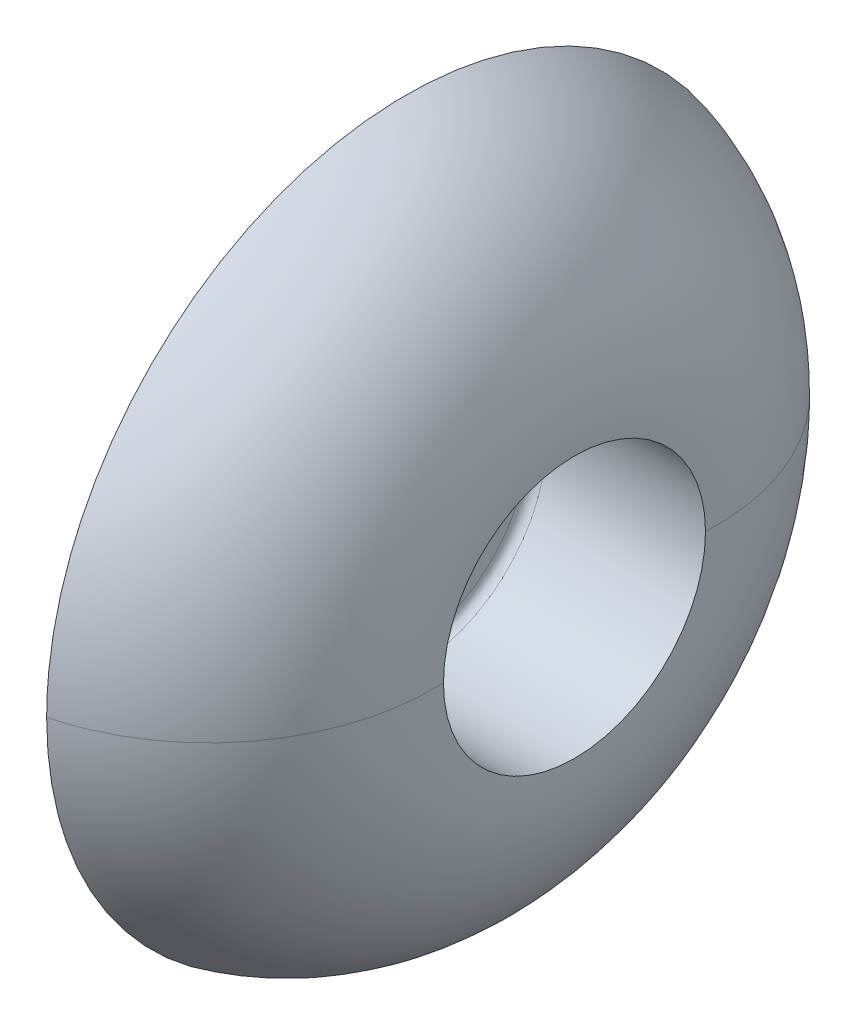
ISO-10303-21;
HEADER;
FILE_DESCRIPTION(('STEP AP214'),'2;1');
FILE_NAME('part.step','',(''),(''),'','','');
FILE_SCHEMA(('AUTOMOTIVE_DESIGN { 1 0 10303 214 1 1 1 1 }'));
ENDSEC;
DATA;
#1=APPLICATION_CONTEXT('core data for automotive mechanical design processes');
#2=APPLICATION_PROTOCOL_DEFINITION('international standard','automotive_design',2000,#1);
#3=PRODUCT_CONTEXT('',#1,'mechanical');
#4=PRODUCT('Part','Part','',(#3));
#5=PRODUCT_RELATED_PRODUCT_CATEGORY('part','',(#4));
#6=PRODUCT_DEFINITION_FORMATION('','',#4);
#7=PRODUCT_DEFINITION_CONTEXT('part definition',#1,'design');
#8=PRODUCT_DEFINITION('design','',#6,#7);
#9=PRODUCT_DEFINITION_SHAPE('','',#8);
#10=(LENGTH_UNIT() NAMED_UNIT(*) SI_UNIT(.MILLI.,.METRE.));
#11=(NAMED_UNIT(*) PLANE_ANGLE_UNIT() SI_UNIT($,.RADIAN.));
#12=(NAMED_UNIT(*) SI_UNIT($,.STERADIAN.) SOLID_ANGLE_UNIT());
#13=UNCERTAINTY_MEASURE_WITH_UNIT(LENGTH_MEASURE(1.E-05),#10,'distance_accuracy_value','');
#14=(GEOMETRIC_REPRESENTATION_CONTEXT(3) GLOBAL_UNCERTAINTY_ASSIGNED_CONTEXT((#13)) GLOBAL_UNIT_ASSIGNED_CONTEXT((#10,
#11,#12)) REPRESENTATION_CONTEXT('',''));
#15=CARTESIAN_POINT('',(0.,0.,0.));
#16=DIRECTION('',(0.,0.,1.));
#17=DIRECTION('',(1.,0.,0.));
#18=AXIS2_PLACEMENT_3D('',#15,#16,#17);
#19=CARTESIAN_POINT('',(15.932169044,0.,0.));
#20=DIRECTION('',(1.,0.,0.));
#21=DIRECTION('',(0.,0.,-1.));
#22=AXIS2_PLACEMENT_3D('',#19,#20,#21);
#23=CYLINDRICAL_SURFACE('',#22,9.5);
#24=CARTESIAN_POINT('',(15.932169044,0.,0.));
#25=DIRECTION('',(-1.,0.,0.));
#26=DIRECTION('',(0.,0.,1.));
#27=AXIS2_PLACEMENT_3D('',#24,#25,#26);
#28=CIRCLE('',#27,9.5);
#29=CARTESIAN_POINT('',(15.932169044,-9.74241285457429E-10,9.5));
#30=VERTEX_POINT('',#29);
#31=CARTESIAN_POINT('',(15.932169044,-4.2651973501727E-10,-9.5));
#32=VERTEX_POINT('',#31);
#33=EDGE_CURVE('E378',#30,#32,#28,.T.);
#34=ORIENTED_EDGE('',*,*,#33,.F.);
#35=CARTESIAN_POINT('',(15.932169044,0.,0.));
#36=DIRECTION('',(-1.,0.,0.));
#37=DIRECTION('',(0.,0.,1.));
#38=AXIS2_PLACEMENT_3D('',#35,#36,#37);
#39=CIRCLE('',#38,9.5);
#40=EDGE_CURVE('E367',#32,#30,#39,.T.);
#41=ORIENTED_EDGE('',*,*,#40,.F.);
#42=EDGE_LOOP('',(#34,#41));
#43=FACE_BOUND('',#42,.T.);
#44=CARTESIAN_POINT('',(22.42785181,0.,0.));
#45=DIRECTION('',(-1.,0.,0.));
#46=DIRECTION('',(0.,0.,1.));
#47=AXIS2_PLACEMENT_3D('',#44,#45,#46);
#48=CIRCLE('',#47,9.5);
#49=CARTESIAN_POINT('',(22.42785181,-4.2651973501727E-10,-9.5));
#50=VERTEX_POINT('',#49);
#51=CARTESIAN_POINT('',(22.42785181,-9.74241285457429E-10,9.5));
#52=VERTEX_POINT('',#51);
#53=EDGE_CURVE('E338',#50,#52,#48,.T.);
#54=ORIENTED_EDGE('',*,*,#53,.T.);
#55=CARTESIAN_POINT('',(22.42785181,0.,0.));
#56=DIRECTION('',(-1.,0.,0.));
#57=DIRECTION('',(0.,0.,1.));
#58=AXIS2_PLACEMENT_3D('',#55,#56,#57);
#59=CIRCLE('',#58,9.5);
#60=EDGE_CURVE('E349',#52,#50,#59,.T.);
#61=ORIENTED_EDGE('',*,*,#60,.T.);
#62=EDGE_LOOP('',(#54,#61));
#63=FACE_BOUND('',#62,.T.);
#64=ADVANCED_FACE('F32',(#43,#63),#23,.T.);
#65=CARTESIAN_POINT('',(14.944197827,0.,8.654637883));
#66=CARTESIAN_POINT('',(14.944197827,17.309275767,8.654637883));
#67=CARTESIAN_POINT('',(14.944197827,17.309275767,-8.654637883));
#68=CARTESIAN_POINT('',(14.944197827,0.,-8.654637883));
#69=CARTESIAN_POINT('',(15.024000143,0.,9.1644896));
#70=CARTESIAN_POINT('',(15.024000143,18.3289792,9.1644896));
#71=CARTESIAN_POINT('',(15.024000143,18.3289792,-9.1644896));
#72=CARTESIAN_POINT('',(15.024000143,0.,-9.1644896));
#73=CARTESIAN_POINT('',(15.416109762,0.,9.5));
#74=CARTESIAN_POINT('',(15.416109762,19.,9.5));
#75=CARTESIAN_POINT('',(15.416109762,19.,-9.5));
#76=CARTESIAN_POINT('',(15.416109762,0.,-9.5));
#77=CARTESIAN_POINT('',(15.932169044,0.,9.5));
#78=CARTESIAN_POINT('',(15.932169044,19.,9.5));
#79=CARTESIAN_POINT('',(15.932169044,19.,-9.5));
#80=CARTESIAN_POINT('',(15.932169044,0.,-9.5));
#81=(BOUNDED_SURFACE() B_SPLINE_SURFACE(3,3,((#65,#66,#67,#68),(#69,#70,#71,#72),(#73,#74,#75,
#76),(#77,#78,#79,#80)),.UNSPECIFIED.,.F.,.F.,.F.) B_SPLINE_SURFACE_WITH_KNOTS((4,4),(4,4),(0.,
1.),(0.,1.),.UNSPECIFIED.) GEOMETRIC_REPRESENTATION_ITEM() RATIONAL_B_SPLINE_SURFACE(((1.,
0.333333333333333,0.333333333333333,1.),(0.839876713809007,0.279958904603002,0.279958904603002,
0.839876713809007),(0.839876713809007,0.279958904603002,0.279958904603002,0.839876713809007),
(1.,0.333333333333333,0.333333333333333,1.))) REPRESENTATION_ITEM('') SURFACE());
#82=CARTESIAN_POINT('',(14.944197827,0.,0.));
#83=DIRECTION('',(1.,0.,0.));
#84=DIRECTION('',(0.,0.,-1.));
#85=AXIS2_PLACEMENT_3D('',#82,#83,#84);
#86=CIRCLE('',#85,8.654637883);
#87=CARTESIAN_POINT('',(14.944197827,0.,-8.654637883));
#88=VERTEX_POINT('',#87);
#89=CARTESIAN_POINT('',(14.944197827,0.,8.654637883));
#90=VERTEX_POINT('',#89);
#91=EDGE_CURVE('E322',#88,#90,#86,.T.);
#92=CARTESIAN_POINT('',(14.944197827,0.,8.654637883));
#93=CARTESIAN_POINT('',(15.024000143,0.,9.1644896));
#94=CARTESIAN_POINT('',(15.416109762,0.,9.5));
#95=CARTESIAN_POINT('',(15.932169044,0.,9.5));
#96=(BOUNDED_CURVE() B_SPLINE_CURVE(3,(#92,#93,#94,#95),.UNSPECIFIED.,.F.,
.F.) B_SPLINE_CURVE_WITH_KNOTS((4,4),(0.,1.),
.UNSPECIFIED.) CURVE() GEOMETRIC_REPRESENTATION_ITEM() RATIONAL_B_SPLINE_CURVE((1.,
0.839876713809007,0.839876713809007,1.)) REPRESENTATION_ITEM(''));
#97=EDGE_CURVE('E365',#30,#90,#96,.F.);
#98=CARTESIAN_POINT('',(14.944197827,0.,-8.654637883));
#99=CARTESIAN_POINT('',(15.024000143,0.,-9.1644896));
#100=CARTESIAN_POINT('',(15.416109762,0.,-9.5));
#101=CARTESIAN_POINT('',(15.932169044,0.,-9.5));
#102=(BOUNDED_CURVE() B_SPLINE_CURVE(3,(#98,#99,#100,#101),.UNSPECIFIED.,.F.,
.F.) B_SPLINE_CURVE_WITH_KNOTS((4,4),(0.,1.),
.UNSPECIFIED.) CURVE() GEOMETRIC_REPRESENTATION_ITEM() RATIONAL_B_SPLINE_CURVE((1.,
0.839876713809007,0.839876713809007,1.)) REPRESENTATION_ITEM(''));
#103=EDGE_CURVE('E372',#88,#32,#102,.T.);
#104=ORIENTED_EDGE('',*,*,#91,.T.);
#105=ORIENTED_EDGE('',*,*,#97,.F.);
#106=ORIENTED_EDGE('',*,*,#33,.T.);
#107=ORIENTED_EDGE('',*,*,#103,.F.);
#108=EDGE_LOOP('',(#104,#105,#106,#107));
#109=FACE_BOUND('',#108,.T.);
#110=ADVANCED_FACE('F447',(#109),#81,.T.);
#111=CARTESIAN_POINT('',(14.944197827,0.,-8.654637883));
#112=CARTESIAN_POINT('',(14.944197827,-17.309275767,-8.654637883));
#113=CARTESIAN_POINT('',(14.944197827,-17.309275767,8.654637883));
#114=CARTESIAN_POINT('',(14.944197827,0.,8.654637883));
#115=CARTESIAN_POINT('',(15.024000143,0.,-9.1644896));
#116=CARTESIAN_POINT('',(15.024000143,-18.3289792,-9.1644896));
#117=CARTESIAN_POINT('',(15.024000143,-18.3289792,9.1644896));
#118=CARTESIAN_POINT('',(15.024000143,0.,9.1644896));
#119=CARTESIAN_POINT('',(15.416109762,0.,-9.5));
#120=CARTESIAN_POINT('',(15.416109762,-19.,-9.5));
#121=CARTESIAN_POINT('',(15.416109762,-19.,9.5));
#122=CARTESIAN_POINT('',(15.416109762,0.,9.5));
#123=CARTESIAN_POINT('',(15.932169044,0.,-9.5));
#124=CARTESIAN_POINT('',(15.932169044,-19.,-9.5));
#125=CARTESIAN_POINT('',(15.932169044,-19.,9.5));
#126=CARTESIAN_POINT('',(15.932169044,0.,9.5));
#127=(BOUNDED_SURFACE() B_SPLINE_SURFACE(3,3,((#111,#112,#113,#114),(#115,#116,#117,#118),(#119,
#120,#121,#122),(#123,#124,#125,#126)),.UNSPECIFIED.,.F.,.F.,
.F.) B_SPLINE_SURFACE_WITH_KNOTS((4,4),(4,4),(0.,1.),(0.,1.),
.UNSPECIFIED.) GEOMETRIC_REPRESENTATION_ITEM() RATIONAL_B_SPLINE_SURFACE(((1.,0.333333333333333,
0.333333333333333,1.),(0.839876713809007,0.279958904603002,0.279958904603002,0.839876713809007),
(0.839876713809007,0.279958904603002,0.279958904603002,0.839876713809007),(1.,0.333333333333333,
0.333333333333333,1.))) REPRESENTATION_ITEM('') SURFACE());
#128=CARTESIAN_POINT('',(14.944197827,0.,0.));
#129=DIRECTION('',(1.,0.,0.));
#130=DIRECTION('',(0.,0.,-1.));
#131=AXIS2_PLACEMENT_3D('',#128,#129,#130);
#132=CIRCLE('',#131,8.654637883);
#133=EDGE_CURVE('E311',#90,#88,#132,.T.);
#134=ORIENTED_EDGE('',*,*,#97,.T.);
#135=ORIENTED_EDGE('',*,*,#133,.T.);
#136=ORIENTED_EDGE('',*,*,#103,.T.);
#137=ORIENTED_EDGE('',*,*,#40,.T.);
#138=EDGE_LOOP('',(#134,#135,#136,#137));
#139=FACE_BOUND('',#138,.T.);
#140=ADVANCED_FACE('F442',(#139),#127,.T.);
#141=CARTESIAN_POINT('',(22.42785181,0.,-9.5));
#142=CARTESIAN_POINT('',(22.42785181,19.,-9.5));
#143=CARTESIAN_POINT('',(22.42785181,19.,9.5));
#144=CARTESIAN_POINT('',(22.42785181,0.,9.5));
#145=CARTESIAN_POINT('',(23.191938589,0.,-9.5));
#146=CARTESIAN_POINT('',(23.191938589,19.,-9.5));
#147=CARTESIAN_POINT('',(23.191938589,19.,9.5));
#148=CARTESIAN_POINT('',(23.191938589,0.,9.5));
#149=CARTESIAN_POINT('',(23.629598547,0.,-10.126324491));
#150=CARTESIAN_POINT('',(23.629598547,20.252648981,-10.126324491));
#151=CARTESIAN_POINT('',(23.629598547,20.252648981,10.126324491));
#152=CARTESIAN_POINT('',(23.629598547,0.,10.126324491));
#153=CARTESIAN_POINT('',(23.366884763,0.,-10.843827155));
#154=CARTESIAN_POINT('',(23.366884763,21.687654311,-10.843827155));
#155=CARTESIAN_POINT('',(23.366884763,21.687654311,10.843827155));
#156=CARTESIAN_POINT('',(23.366884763,0.,10.843827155));
#157=(BOUNDED_SURFACE() B_SPLINE_SURFACE(3,3,((#141,#142,#143,#144),(#145,#146,#147,#148),(#149,
#150,#151,#152),(#153,#154,#155,#156)),.UNSPECIFIED.,.F.,.F.,
.F.) B_SPLINE_SURFACE_WITH_KNOTS((4,4),(4,4),(0.,1.),(0.,1.),
.UNSPECIFIED.) GEOMETRIC_REPRESENTATION_ITEM() RATIONAL_B_SPLINE_SURFACE(((1.,0.333333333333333,
0.333333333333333,1.),(0.715192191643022,0.238397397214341,0.238397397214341,0.715192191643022),
(0.715192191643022,0.238397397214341,0.238397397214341,0.715192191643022),(1.,0.333333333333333,
0.333333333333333,1.))) REPRESENTATION_ITEM('') SURFACE());
#158=CARTESIAN_POINT('',(23.366884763,0.,0.));
#159=DIRECTION('',(-1.,0.,0.));
#160=DIRECTION('',(0.,0.,1.));
#161=AXIS2_PLACEMENT_3D('',#158,#159,#160);
#162=CIRCLE('',#161,10.843827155);
#163=CARTESIAN_POINT('',(23.366884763,0.,10.843827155));
#164=VERTEX_POINT('',#163);
#165=CARTESIAN_POINT('',(23.366884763,0.,-10.843827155));
#166=VERTEX_POINT('',#165);
#167=EDGE_CURVE('E123',#164,#166,#162,.T.);
#168=CARTESIAN_POINT('',(22.42785181,0.,-9.5));
#169=CARTESIAN_POINT('',(23.191938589,0.,-9.5));
#170=CARTESIAN_POINT('',(23.629598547,0.,-10.126324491));
#171=CARTESIAN_POINT('',(23.366884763,0.,-10.843827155));
#172=(BOUNDED_CURVE() B_SPLINE_CURVE(3,(#168,#169,#170,#171),.UNSPECIFIED.,.F.,
.F.) B_SPLINE_CURVE_WITH_KNOTS((4,4),(0.,1.),
.UNSPECIFIED.) CURVE() GEOMETRIC_REPRESENTATION_ITEM() RATIONAL_B_SPLINE_CURVE((1.,
0.715192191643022,0.715192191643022,1.)) REPRESENTATION_ITEM(''));
#173=EDGE_CURVE('E343',#166,#50,#172,.F.);
#174=CARTESIAN_POINT('',(22.42785181,0.,9.5));
#175=CARTESIAN_POINT('',(23.191938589,0.,9.5));
#176=CARTESIAN_POINT('',(23.629598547,0.,10.126324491));
#177=CARTESIAN_POINT('',(23.366884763,0.,10.843827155));
#178=(BOUNDED_CURVE() B_SPLINE_CURVE(3,(#174,#175,#176,#177),.UNSPECIFIED.,.F.,
.F.) B_SPLINE_CURVE_WITH_KNOTS((4,4),(0.,1.),
.UNSPECIFIED.) CURVE() GEOMETRIC_REPRESENTATION_ITEM() RATIONAL_B_SPLINE_CURVE((1.,
0.715192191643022,0.715192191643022,1.)) REPRESENTATION_ITEM(''));
#179=EDGE_CURVE('E336',#52,#164,#178,.T.);
#180=ORIENTED_EDGE('',*,*,#167,.T.);
#181=ORIENTED_EDGE('',*,*,#173,.T.);
#182=ORIENTED_EDGE('',*,*,#60,.F.);
#183=ORIENTED_EDGE('',*,*,#179,.T.);
#184=EDGE_LOOP('',(#180,#181,#182,#183));
#185=FACE_BOUND('',#184,.T.);
#186=ADVANCED_FACE('F457',(#185),#157,.F.);
#187=CARTESIAN_POINT('',(22.42785181,0.,9.5));
#188=CARTESIAN_POINT('',(22.42785181,-19.,9.5));
#189=CARTESIAN_POINT('',(22.42785181,-19.,-9.5));
#190=CARTESIAN_POINT('',(22.42785181,0.,-9.5));
#191=CARTESIAN_POINT('',(23.191938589,0.,9.5));
#192=CARTESIAN_POINT('',(23.191938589,-19.,9.5));
#193=CARTESIAN_POINT('',(23.191938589,-19.,-9.5));
#194=CARTESIAN_POINT('',(23.191938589,0.,-9.5));
#195=CARTESIAN_POINT('',(23.629598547,0.,10.126324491));
#196=CARTESIAN_POINT('',(23.629598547,-20.252648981,10.126324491));
#197=CARTESIAN_POINT('',(23.629598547,-20.252648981,-10.126324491));
#198=CARTESIAN_POINT('',(23.629598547,0.,-10.126324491));
#199=CARTESIAN_POINT('',(23.366884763,0.,10.843827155));
#200=CARTESIAN_POINT('',(23.366884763,-21.687654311,10.843827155));
#201=CARTESIAN_POINT('',(23.366884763,-21.687654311,-10.843827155));
#202=CARTESIAN_POINT('',(23.366884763,0.,-10.843827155));
#203=(BOUNDED_SURFACE() B_SPLINE_SURFACE(3,3,((#187,#188,#189,#190),(#191,#192,#193,#194),(#195,
#196,#197,#198),(#199,#200,#201,#202)),.UNSPECIFIED.,.F.,.F.,
.F.) B_SPLINE_SURFACE_WITH_KNOTS((4,4),(4,4),(0.,1.),(0.,1.),
.UNSPECIFIED.) GEOMETRIC_REPRESENTATION_ITEM() RATIONAL_B_SPLINE_SURFACE(((1.,0.333333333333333,
0.333333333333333,1.),(0.715192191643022,0.238397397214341,0.238397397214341,0.715192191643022),
(0.715192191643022,0.238397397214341,0.238397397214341,0.715192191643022),(1.,0.333333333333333,
0.333333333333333,1.))) REPRESENTATION_ITEM('') SURFACE());
#204=CARTESIAN_POINT('',(23.366884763,0.,0.));
#205=DIRECTION('',(-1.,0.,0.));
#206=DIRECTION('',(0.,0.,1.));
#207=AXIS2_PLACEMENT_3D('',#204,#205,#206);
#208=CIRCLE('',#207,10.843827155);
#209=EDGE_CURVE('E127',#166,#164,#208,.T.);
#210=ORIENTED_EDGE('',*,*,#179,.F.);
#211=ORIENTED_EDGE('',*,*,#53,.F.);
#212=ORIENTED_EDGE('',*,*,#173,.F.);
#213=ORIENTED_EDGE('',*,*,#209,.T.);
#214=EDGE_LOOP('',(#210,#211,#212,#213));
#215=FACE_BOUND('',#214,.T.);
#216=ADVANCED_FACE('F455',(#215),#203,.F.);
#217=CARTESIAN_POINT('',(13.277531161,0.,-6.987971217));
#218=CARTESIAN_POINT('',(13.277531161,13.975942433,-6.987971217));
#219=CARTESIAN_POINT('',(13.277531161,13.975942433,6.987971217));
#220=CARTESIAN_POINT('',(13.277531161,0.,6.987971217));
#221=CARTESIAN_POINT('',(14.167732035,0.,-7.127306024));
#222=CARTESIAN_POINT('',(14.167732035,14.254612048,-7.127306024));
#223=CARTESIAN_POINT('',(14.167732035,14.254612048,7.127306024));
#224=CARTESIAN_POINT('',(14.167732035,0.,7.127306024));
#225=CARTESIAN_POINT('',(14.80486302,0.,-7.764437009));
#226=CARTESIAN_POINT('',(14.80486302,15.528874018,-7.764437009));
#227=CARTESIAN_POINT('',(14.80486302,15.528874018,7.764437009));
#228=CARTESIAN_POINT('',(14.80486302,0.,7.764437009));
#229=CARTESIAN_POINT('',(14.944197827,0.,-8.654637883));
#230=CARTESIAN_POINT('',(14.944197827,17.309275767,-8.654637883));
#231=CARTESIAN_POINT('',(14.944197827,17.309275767,8.654637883));
#232=CARTESIAN_POINT('',(14.944197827,0.,8.654637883));
#233=(BOUNDED_SURFACE() B_SPLINE_SURFACE(3,3,((#217,#218,#219,#220),(#221,#222,#223,#224),(#225,
#226,#227,#228),(#229,#230,#231,#232)),.UNSPECIFIED.,.F.,.F.,
.F.) B_SPLINE_SURFACE_WITH_KNOTS((4,4),(4,4),(0.,1.),(0.,1.),
.UNSPECIFIED.) GEOMETRIC_REPRESENTATION_ITEM() RATIONAL_B_SPLINE_SURFACE(((1.,0.333333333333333,
0.333333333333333,1.),(0.871964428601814,0.290654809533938,0.290654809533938,0.871964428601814),
(0.871964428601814,0.290654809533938,0.290654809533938,0.871964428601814),(1.,0.333333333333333,
0.333333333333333,1.))) REPRESENTATION_ITEM('') SURFACE());
#234=CARTESIAN_POINT('',(13.277531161,0.,-6.987971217));
#235=CARTESIAN_POINT('',(14.167732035,0.,-7.127306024));
#236=CARTESIAN_POINT('',(14.80486302,0.,-7.764437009));
#237=CARTESIAN_POINT('',(14.944197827,0.,-8.654637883));
#238=(BOUNDED_CURVE() B_SPLINE_CURVE(3,(#234,#235,#236,#237),.UNSPECIFIED.,.F.,
.F.) B_SPLINE_CURVE_WITH_KNOTS((4,4),(0.,1.),
.UNSPECIFIED.) CURVE() GEOMETRIC_REPRESENTATION_ITEM() RATIONAL_B_SPLINE_CURVE((1.,
0.871964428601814,0.871964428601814,1.)) REPRESENTATION_ITEM(''));
#239=CARTESIAN_POINT('',(13.277531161,0.,-6.987971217));
#240=VERTEX_POINT('',#239);
#241=EDGE_CURVE('E312',#88,#240,#238,.F.);
#242=CARTESIAN_POINT('',(13.277531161,0.,0.));
#243=DIRECTION('',(-1.,0.,0.));
#244=DIRECTION('',(0.,0.,1.));
#245=AXIS2_PLACEMENT_3D('',#242,#243,#244);
#246=CIRCLE('',#245,6.987971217);
#247=CARTESIAN_POINT('',(13.277531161,0.,6.987971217));
#248=VERTEX_POINT('',#247);
#249=EDGE_CURVE('E126',#248,#240,#246,.T.);
#250=CARTESIAN_POINT('',(13.277531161,0.,6.987971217));
#251=CARTESIAN_POINT('',(14.167732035,0.,7.127306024));
#252=CARTESIAN_POINT('',(14.80486302,0.,7.764437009));
#253=CARTESIAN_POINT('',(14.944197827,0.,8.654637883));
#254=(BOUNDED_CURVE() B_SPLINE_CURVE(3,(#250,#251,#252,#253),.UNSPECIFIED.,.F.,
.F.) B_SPLINE_CURVE_WITH_KNOTS((4,4),(0.,1.),
.UNSPECIFIED.) CURVE() GEOMETRIC_REPRESENTATION_ITEM() RATIONAL_B_SPLINE_CURVE((1.,
0.871964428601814,0.871964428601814,1.)) REPRESENTATION_ITEM(''));
#255=EDGE_CURVE('E308',#248,#90,#254,.T.);
#256=ORIENTED_EDGE('',*,*,#91,.F.);
#257=ORIENTED_EDGE('',*,*,#241,.T.);
#258=ORIENTED_EDGE('',*,*,#249,.F.);
#259=ORIENTED_EDGE('',*,*,#255,.T.);
#260=EDGE_LOOP('',(#256,#257,#258,#259));
#261=FACE_BOUND('',#260,.T.);
#262=ADVANCED_FACE('F436',(#261),#233,.F.);
#263=CARTESIAN_POINT('',(13.277531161,0.,6.987971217));
#264=CARTESIAN_POINT('',(13.277531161,-13.975942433,6.987971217));
#265=CARTESIAN_POINT('',(13.277531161,-13.975942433,-6.987971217));
#266=CARTESIAN_POINT('',(13.277531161,0.,-6.987971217));
#267=CARTESIAN_POINT('',(14.167732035,0.,7.127306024));
#268=CARTESIAN_POINT('',(14.167732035,-14.254612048,7.127306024));
#269=CARTESIAN_POINT('',(14.167732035,-14.254612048,-7.127306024));
#270=CARTESIAN_POINT('',(14.167732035,0.,-7.127306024));
#271=CARTESIAN_POINT('',(14.80486302,0.,7.764437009));
#272=CARTESIAN_POINT('',(14.80486302,-15.528874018,7.764437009));
#273=CARTESIAN_POINT('',(14.80486302,-15.528874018,-7.764437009));
#274=CARTESIAN_POINT('',(14.80486302,0.,-7.764437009));
#275=CARTESIAN_POINT('',(14.944197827,0.,8.654637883));
#276=CARTESIAN_POINT('',(14.944197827,-17.309275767,8.654637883));
#277=CARTESIAN_POINT('',(14.944197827,-17.309275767,-8.654637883));
#278=CARTESIAN_POINT('',(14.944197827,0.,-8.654637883));
#279=(BOUNDED_SURFACE() B_SPLINE_SURFACE(3,3,((#263,#264,#265,#266),(#267,#268,#269,#270),(#271,
#272,#273,#274),(#275,#276,#277,#278)),.UNSPECIFIED.,.F.,.F.,
.F.) B_SPLINE_SURFACE_WITH_KNOTS((4,4),(4,4),(0.,1.),(0.,1.),
.UNSPECIFIED.) GEOMETRIC_REPRESENTATION_ITEM() RATIONAL_B_SPLINE_SURFACE(((1.,0.333333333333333,
0.333333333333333,1.),(0.871964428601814,0.290654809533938,0.290654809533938,0.871964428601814),
(0.871964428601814,0.290654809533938,0.290654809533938,0.871964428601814),(1.,0.333333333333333,
0.333333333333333,1.))) REPRESENTATION_ITEM('') SURFACE());
#280=CARTESIAN_POINT('',(13.277531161,0.,0.));
#281=DIRECTION('',(-1.,0.,0.));
#282=DIRECTION('',(0.,0.,1.));
#283=AXIS2_PLACEMENT_3D('',#280,#281,#282);
#284=CIRCLE('',#283,6.987971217);
#285=EDGE_CURVE('E303',#240,#248,#284,.T.);
#286=ORIENTED_EDGE('',*,*,#255,.F.);
#287=ORIENTED_EDGE('',*,*,#285,.F.);
#288=ORIENTED_EDGE('',*,*,#241,.F.);
#289=ORIENTED_EDGE('',*,*,#133,.F.);
#290=EDGE_LOOP('',(#286,#287,#288,#289));
#291=FACE_BOUND('',#290,.T.);
#292=ADVANCED_FACE('F440',(#291),#279,.F.);
#293=CARTESIAN_POINT('',(23.366884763,0.,-10.843827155));
#294=CARTESIAN_POINT('',(23.366884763,21.687654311,-10.843827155));
#295=CARTESIAN_POINT('',(23.366884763,21.687654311,10.843827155));
#296=CARTESIAN_POINT('',(23.366884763,0.,10.843827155));
#297=CARTESIAN_POINT('',(22.352312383,0.,-13.614745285));
#298=CARTESIAN_POINT('',(22.352312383,27.22949057,-13.614745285));
#299=CARTESIAN_POINT('',(22.352312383,27.22949057,13.614745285));
#300=CARTESIAN_POINT('',(22.352312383,0.,13.614745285));
#301=CARTESIAN_POINT('',(20.233427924,0.,-15.668442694));
#302=CARTESIAN_POINT('',(20.233427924,31.336885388,-15.668442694));
#303=CARTESIAN_POINT('',(20.233427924,31.336885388,15.668442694));
#304=CARTESIAN_POINT('',(20.233427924,0.,15.668442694));
#305=CARTESIAN_POINT('',(17.432169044,0.,-16.59596255));
#306=CARTESIAN_POINT('',(17.432169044,33.191925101,-16.59596255));
#307=CARTESIAN_POINT('',(17.432169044,33.191925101,16.59596255));
#308=CARTESIAN_POINT('',(17.432169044,0.,16.59596255));
#309=(BOUNDED_SURFACE() B_SPLINE_SURFACE(3,3,((#293,#294,#295,#296),(#297,#298,#299,#300),(#301,
#302,#303,#304),(#305,#306,#307,#308)),.UNSPECIFIED.,.F.,.F.,
.F.) B_SPLINE_SURFACE_WITH_KNOTS((4,4),(4,4),(0.,1.),(0.,1.),
.UNSPECIFIED.) GEOMETRIC_REPRESENTATION_ITEM() RATIONAL_B_SPLINE_SURFACE(((1.,0.333333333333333,
0.333333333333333,1.),(0.93362267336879,0.311207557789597,0.311207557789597,0.93362267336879),
(0.93362267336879,0.311207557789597,0.311207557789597,0.93362267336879),(1.,0.333333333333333,
0.333333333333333,1.))) REPRESENTATION_ITEM('') SURFACE());
#310=CARTESIAN_POINT('',(17.432169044,0.,-16.59596255));
#311=CARTESIAN_POINT('',(17.432169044,0.401392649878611,-16.5959895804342));
#312=CARTESIAN_POINT('',(17.432169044,0.802780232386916,-16.5814012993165));
#313=CARTESIAN_POINT('',(17.432169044,1.60339237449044,-16.5231939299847));
#314=CARTESIAN_POINT('',(17.432169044,2.00261721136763,-16.4795786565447));
#315=CARTESIAN_POINT('',(17.432169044,2.79702874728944,-16.3634920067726));
#316=CARTESIAN_POINT('',(17.432169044,3.19221363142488,-16.2910081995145));
#317=CARTESIAN_POINT('',(17.432169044,3.97631616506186,-16.117572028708));
#318=CARTESIAN_POINT('',(17.432169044,4.36523314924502,-16.0166166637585));
#319=CARTESIAN_POINT('',(17.432169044,5.19700540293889,-15.7681547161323));
#320=CARTESIAN_POINT('',(17.432169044,5.63840945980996,-15.6157596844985));
#321=CARTESIAN_POINT('',(17.432169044,6.50683853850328,-15.2743170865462));
#322=CARTESIAN_POINT('',(17.432169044,6.93386209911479,-15.0852658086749));
#323=CARTESIAN_POINT('',(17.432169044,7.77048036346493,-14.6718544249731));
#324=CARTESIAN_POINT('',(17.432169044,8.18007461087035,-14.4474933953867));
#325=CARTESIAN_POINT('',(17.432169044,8.97889353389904,-13.965069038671));
#326=CARTESIAN_POINT('',(17.432169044,9.36811875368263,-13.7070066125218));
#327=CARTESIAN_POINT('',(17.432169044,10.1234220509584,-13.159026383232));
#328=CARTESIAN_POINT('',(17.432169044,10.4895015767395,-12.8691105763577));
#329=CARTESIAN_POINT('',(17.432169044,11.1959396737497,-12.2594693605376));
#330=CARTESIAN_POINT('',(17.432169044,11.536298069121,-11.9397437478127));
#331=CARTESIAN_POINT('',(17.432169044,12.1888975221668,-11.272731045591));
#332=CARTESIAN_POINT('',(17.432169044,12.5011363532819,-10.9254417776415));
#333=CARTESIAN_POINT('',(17.432169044,13.0952458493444,-10.2057936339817));
#334=CARTESIAN_POINT('',(17.432169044,13.3771165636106,-9.83343479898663));
#335=CARTESIAN_POINT('',(17.432169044,13.908481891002,-9.06630088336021));
#336=CARTESIAN_POINT('',(17.432169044,14.1579770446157,-8.67152617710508));
#337=CARTESIAN_POINT('',(17.432169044,14.6228230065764,-7.86236145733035));
#338=CARTESIAN_POINT('',(17.432169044,14.8381738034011,-7.44797143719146));
#339=CARTESIAN_POINT('',(17.432169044,15.233190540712,-6.6025423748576));
#340=CARTESIAN_POINT('',(17.432169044,15.4128581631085,-6.17150411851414));
#341=CARTESIAN_POINT('',(17.432169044,15.735243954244,-5.29582453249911));
#342=CARTESIAN_POINT('',(17.432169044,15.877962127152,-4.8511832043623));
#343=CARTESIAN_POINT('',(17.432169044,16.12543609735,-3.9514524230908));
#344=CARTESIAN_POINT('',(17.432169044,16.2301913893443,-3.49636283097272));
#345=CARTESIAN_POINT('',(17.432169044,16.4009922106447,-2.57897656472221));
#346=CARTESIAN_POINT('',(17.432169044,16.4670377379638,-2.11667989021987));
#347=CARTESIAN_POINT('',(17.432169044,16.5599504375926,-1.18815655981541));
#348=CARTESIAN_POINT('',(17.432169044,16.5868168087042,-0.721929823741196));
#349=CARTESIAN_POINT('',(17.432169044,16.6011776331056,0.211129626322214));
#350=CARTESIAN_POINT('',(17.432169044,16.5886720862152,0.67796234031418));
#351=CARTESIAN_POINT('',(17.432169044,16.5243781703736,1.60891208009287));
#352=CARTESIAN_POINT('',(17.432169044,16.4725900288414,2.07302912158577));
#353=CARTESIAN_POINT('',(17.432169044,16.3300993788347,2.99525061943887));
#354=CARTESIAN_POINT('',(17.432169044,16.2393968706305,3.45335507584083));
#355=CARTESIAN_POINT('',(17.432169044,16.0197233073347,4.36029050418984));
#356=CARTESIAN_POINT('',(17.432169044,15.8907525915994,4.80912155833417));
#357=CARTESIAN_POINT('',(17.432169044,15.5954592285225,5.69432345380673));
#358=CARTESIAN_POINT('',(17.432169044,15.4291365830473,6.13069429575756));
#359=CARTESIAN_POINT('',(17.432169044,15.0603192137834,6.98787944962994));
#360=CARTESIAN_POINT('',(17.432169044,14.8578239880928,7.40869354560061));
#361=CARTESIAN_POINT('',(17.432169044,14.4181026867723,8.23176710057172));
#362=CARTESIAN_POINT('',(17.432169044,14.1808766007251,8.63402655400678));
#363=CARTESIAN_POINT('',(17.432169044,13.6733845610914,9.41712374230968));
#364=CARTESIAN_POINT('',(17.432169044,13.4031192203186,9.79796187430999));
#365=CARTESIAN_POINT('',(17.432169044,12.8314682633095,10.5355157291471));
#366=CARTESIAN_POINT('',(17.432169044,12.5300826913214,10.892231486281));
#367=CARTESIAN_POINT('',(17.432169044,11.8983569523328,11.5789773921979));
#368=CARTESIAN_POINT('',(17.432169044,11.5680193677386,11.9090099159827));
#369=CARTESIAN_POINT('',(17.432169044,10.8807305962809,12.5400701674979));
#370=CARTESIAN_POINT('',(17.432169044,10.5237792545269,12.8410977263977));
#371=CARTESIAN_POINT('',(17.432169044,9.7856602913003,13.4121031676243));
#372=CARTESIAN_POINT('',(17.432169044,9.40448779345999,13.6820747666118));
#373=CARTESIAN_POINT('',(17.432169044,8.81682215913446,14.0621511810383));
#374=CARTESIAN_POINT('',(17.432169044,8.61827522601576,14.1847003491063));
#375=CARTESIAN_POINT('',(17.432169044,8.21614057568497,14.421353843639));
#376=CARTESIAN_POINT('',(17.432169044,8.01255157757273,14.5354559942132));
#377=CARTESIAN_POINT('',(17.432169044,7.39472444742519,14.864784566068));
#378=CARTESIAN_POINT('',(17.432169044,6.97346648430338,15.0670070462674));
#379=CARTESIAN_POINT('',(17.432169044,6.11540103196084,15.435213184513));
#380=CARTESIAN_POINT('',(17.432169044,5.67859356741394,15.6011969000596));
#381=CARTESIAN_POINT('',(17.432169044,5.01432388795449,15.8220407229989));
#382=CARTESIAN_POINT('',(17.432169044,4.79145142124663,15.8909521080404));
#383=CARTESIAN_POINT('',(17.432169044,4.34305954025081,16.0193064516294));
#384=CARTESIAN_POINT('',(17.432169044,4.1175408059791,16.0787517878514));
#385=CARTESIAN_POINT('',(17.432169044,3.4376558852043,16.2427129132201));
#386=CARTESIAN_POINT('',(17.432169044,2.97974645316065,16.3329251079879));
#387=CARTESIAN_POINT('',(17.432169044,2.10193013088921,16.467721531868));
#388=CARTESIAN_POINT('',(17.432169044,1.68255521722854,16.5158318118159));
#389=CARTESIAN_POINT('',(17.432169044,0.842132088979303,16.5799359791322));
#390=CARTESIAN_POINT('',(17.432169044,0.4210883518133,16.5959885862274));
#391=CARTESIAN_POINT('',(17.432169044,0.,16.59596255));
#392=B_SPLINE_CURVE_WITH_KNOTS('',3,(#310,#311,#312,#313,#314,#315,#316,#317,#318,#319,#320,
#321,#322,#323,#324,#325,#326,#327,#328,#329,#330,#331,#332,#333,#334,#335,#336,#337,#338,#339,
#340,#341,#342,#343,#344,#345,#346,#347,#348,#349,#350,#351,#352,#353,#354,#355,#356,#357,#358,
#359,#360,#361,#362,#363,#364,#365,#366,#367,#368,#369,#370,#371,#372,#373,#374,#375,#376,#377,
#378,#379,#380,#381,#382,#383,#384,#385,#386,#387,#388,#389,#390,#391),.UNSPECIFIED.,.F.,.F.,(4,
2,2,2,2,2,2,2,2,2,2,2,2,2,2,2,2,2,2,2,2,2,2,2,2,2,2,2,2,2,2,2,2,2,2,2,2,2,2,2,4),(0.,
1.20390478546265,2.40765138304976,3.61191688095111,4.81630937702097,6.21552025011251,
7.61487287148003,9.01426210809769,10.4136139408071,11.8128781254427,13.2121518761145,
14.6115363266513,16.0109185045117,17.4102773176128,18.8096366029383,20.2089299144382,
21.608223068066,23.0075348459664,24.4068466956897,25.8061871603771,27.2055276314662,
28.6048600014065,30.004192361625,31.4035123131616,32.8028321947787,34.2021714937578,
35.601511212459,37.0008249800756,38.4001367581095,39.7993238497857,41.1985190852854,
42.5979969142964,43.297784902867,43.9977525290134,45.3978313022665,46.7979078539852,
47.4975738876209,48.197063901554,49.5953678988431,50.8605599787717,52.1234324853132),.UNSPECIFIED.);
#393=CARTESIAN_POINT('',(17.432169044,0.,-16.59596255));
#394=VERTEX_POINT('',#393);
#395=CARTESIAN_POINT('',(17.432169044,0.,16.59596255));
#396=VERTEX_POINT('',#395);
#397=EDGE_CURVE('E36',#394,#396,#392,.T.);
#398=CARTESIAN_POINT('',(23.366884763,0.,-10.843827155));
#399=CARTESIAN_POINT('',(22.352312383,0.,-13.614745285));
#400=CARTESIAN_POINT('',(20.233427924,0.,-15.668442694));
#401=CARTESIAN_POINT('',(17.432169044,0.,-16.59596255));
#402=(BOUNDED_CURVE() B_SPLINE_CURVE(3,(#398,#399,#400,#401),.UNSPECIFIED.,.F.,
.F.) B_SPLINE_CURVE_WITH_KNOTS((4,4),(0.,1.),
.UNSPECIFIED.) CURVE() GEOMETRIC_REPRESENTATION_ITEM() RATIONAL_B_SPLINE_CURVE((1.,
0.93362267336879,0.93362267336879,1.)) REPRESENTATION_ITEM(''));
#403=EDGE_CURVE('E108',#394,#166,#402,.F.);
#404=CARTESIAN_POINT('',(23.366884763,0.,10.843827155));
#405=CARTESIAN_POINT('',(22.352312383,0.,13.614745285));
#406=CARTESIAN_POINT('',(20.233427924,0.,15.668442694));
#407=CARTESIAN_POINT('',(17.432169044,0.,16.59596255));
#408=(BOUNDED_CURVE() B_SPLINE_CURVE(3,(#404,#405,#406,#407),.UNSPECIFIED.,.F.,
.F.) B_SPLINE_CURVE_WITH_KNOTS((4,4),(0.,1.),
.UNSPECIFIED.) CURVE() GEOMETRIC_REPRESENTATION_ITEM() RATIONAL_B_SPLINE_CURVE((1.,
0.93362267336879,0.93362267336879,1.)) REPRESENTATION_ITEM(''));
#409=EDGE_CURVE('E120',#164,#396,#408,.T.);
#410=ORIENTED_EDGE('',*,*,#397,.F.);
#411=ORIENTED_EDGE('',*,*,#403,.T.);
#412=ORIENTED_EDGE('',*,*,#167,.F.);
#413=ORIENTED_EDGE('',*,*,#409,.T.);
#414=EDGE_LOOP('',(#410,#411,#412,#413));
#415=FACE_BOUND('',#414,.T.);
#416=ADVANCED_FACE('F121',(#415),#309,.F.);
#417=CARTESIAN_POINT('',(23.366884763,0.,10.843827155));
#418=CARTESIAN_POINT('',(23.366884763,-21.687654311,10.843827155));
#419=CARTESIAN_POINT('',(23.366884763,-21.687654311,-10.843827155));
#420=CARTESIAN_POINT('',(23.366884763,0.,-10.843827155));
#421=CARTESIAN_POINT('',(22.352312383,0.,13.614745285));
#422=CARTESIAN_POINT('',(22.352312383,-27.22949057,13.614745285));
#423=CARTESIAN_POINT('',(22.352312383,-27.22949057,-13.614745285));
#424=CARTESIAN_POINT('',(22.352312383,0.,-13.614745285));
#425=CARTESIAN_POINT('',(20.233427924,0.,15.668442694));
#426=CARTESIAN_POINT('',(20.233427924,-31.336885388,15.668442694));
#427=CARTESIAN_POINT('',(20.233427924,-31.336885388,-15.668442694));
#428=CARTESIAN_POINT('',(20.233427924,0.,-15.668442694));
#429=CARTESIAN_POINT('',(17.432169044,0.,16.59596255));
#430=CARTESIAN_POINT('',(17.432169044,-33.191925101,16.59596255));
#431=CARTESIAN_POINT('',(17.432169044,-33.191925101,-16.59596255));
#432=CARTESIAN_POINT('',(17.432169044,0.,-16.59596255));
#433=(BOUNDED_SURFACE() B_SPLINE_SURFACE(3,3,((#417,#418,#419,#420),(#421,#422,#423,#424),(#425,
#426,#427,#428),(#429,#430,#431,#432)),.UNSPECIFIED.,.F.,.F.,
.F.) B_SPLINE_SURFACE_WITH_KNOTS((4,4),(4,4),(0.,1.),(0.,1.),
.UNSPECIFIED.) GEOMETRIC_REPRESENTATION_ITEM() RATIONAL_B_SPLINE_SURFACE(((1.,0.333333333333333,
0.333333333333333,1.),(0.93362267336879,0.311207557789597,0.311207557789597,0.93362267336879),
(0.93362267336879,0.311207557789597,0.311207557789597,0.93362267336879),(1.,0.333333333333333,
0.333333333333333,1.))) REPRESENTATION_ITEM('') SURFACE());
#434=CARTESIAN_POINT('',(17.432169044,0.,16.59596255));
#435=CARTESIAN_POINT('',(17.432169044,-0.401392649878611,16.5959895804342));
#436=CARTESIAN_POINT('',(17.432169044,-0.802780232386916,16.5814012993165));
#437=CARTESIAN_POINT('',(17.432169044,-1.60339237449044,16.5231939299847));
#438=CARTESIAN_POINT('',(17.432169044,-2.00261721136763,16.4795786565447));
#439=CARTESIAN_POINT('',(17.432169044,-2.79702874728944,16.3634920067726));
#440=CARTESIAN_POINT('',(17.432169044,-3.19221363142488,16.2910081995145));
#441=CARTESIAN_POINT('',(17.432169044,-3.97631616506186,16.117572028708));
#442=CARTESIAN_POINT('',(17.432169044,-4.36523314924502,16.0166166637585));
#443=CARTESIAN_POINT('',(17.432169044,-5.19700540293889,15.7681547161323));
#444=CARTESIAN_POINT('',(17.432169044,-5.63840945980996,15.6157596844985));
#445=CARTESIAN_POINT('',(17.432169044,-6.50683853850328,15.2743170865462));
#446=CARTESIAN_POINT('',(17.432169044,-6.93386209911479,15.0852658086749));
#447=CARTESIAN_POINT('',(17.432169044,-7.77048036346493,14.6718544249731));
#448=CARTESIAN_POINT('',(17.432169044,-8.18007461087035,14.4474933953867));
#449=CARTESIAN_POINT('',(17.432169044,-8.97889353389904,13.965069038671));
#450=CARTESIAN_POINT('',(17.432169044,-9.36811875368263,13.7070066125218));
#451=CARTESIAN_POINT('',(17.432169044,-10.1234220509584,13.159026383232));
#452=CARTESIAN_POINT('',(17.432169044,-10.4895015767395,12.8691105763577));
#453=CARTESIAN_POINT('',(17.432169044,-11.1959396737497,12.2594693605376));
#454=CARTESIAN_POINT('',(17.432169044,-11.536298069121,11.9397437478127));
#455=CARTESIAN_POINT('',(17.432169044,-12.1888975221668,11.272731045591));
#456=CARTESIAN_POINT('',(17.432169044,-12.5011363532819,10.9254417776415));
#457=CARTESIAN_POINT('',(17.432169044,-13.0952458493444,10.2057936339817));
#458=CARTESIAN_POINT('',(17.432169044,-13.3771165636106,9.83343479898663));
#459=CARTESIAN_POINT('',(17.432169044,-13.908481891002,9.06630088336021));
#460=CARTESIAN_POINT('',(17.432169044,-14.1579770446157,8.67152617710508));
#461=CARTESIAN_POINT('',(17.432169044,-14.6228230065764,7.86236145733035));
#462=CARTESIAN_POINT('',(17.432169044,-14.8381738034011,7.44797143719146));
#463=CARTESIAN_POINT('',(17.432169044,-15.233190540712,6.6025423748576));
#464=CARTESIAN_POINT('',(17.432169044,-15.4128581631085,6.17150411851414));
#465=CARTESIAN_POINT('',(17.432169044,-15.735243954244,5.29582453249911));
#466=CARTESIAN_POINT('',(17.432169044,-15.877962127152,4.8511832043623));
#467=CARTESIAN_POINT('',(17.432169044,-16.12543609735,3.9514524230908));
#468=CARTESIAN_POINT('',(17.432169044,-16.2301913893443,3.49636283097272));
#469=CARTESIAN_POINT('',(17.432169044,-16.4009922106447,2.57897656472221));
#470=CARTESIAN_POINT('',(17.432169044,-16.4670377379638,2.11667989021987));
#471=CARTESIAN_POINT('',(17.432169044,-16.5599504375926,1.18815655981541));
#472=CARTESIAN_POINT('',(17.432169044,-16.5868168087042,0.721929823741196));
#473=CARTESIAN_POINT('',(17.432169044,-16.6011776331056,-0.211129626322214));
#474=CARTESIAN_POINT('',(17.432169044,-16.5886720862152,-0.67796234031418));
#475=CARTESIAN_POINT('',(17.432169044,-16.5243781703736,-1.60891208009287));
#476=CARTESIAN_POINT('',(17.432169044,-16.4725900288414,-2.07302912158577));
#477=CARTESIAN_POINT('',(17.432169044,-16.3300993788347,-2.99525061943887));
#478=CARTESIAN_POINT('',(17.432169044,-16.2393968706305,-3.45335507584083));
#479=CARTESIAN_POINT('',(17.432169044,-16.0197233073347,-4.36029050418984));
#480=CARTESIAN_POINT('',(17.432169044,-15.8907525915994,-4.80912155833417));
#481=CARTESIAN_POINT('',(17.432169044,-15.5954592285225,-5.69432345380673));
#482=CARTESIAN_POINT('',(17.432169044,-15.4291365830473,-6.13069429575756));
#483=CARTESIAN_POINT('',(17.432169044,-15.0603192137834,-6.98787944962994));
#484=CARTESIAN_POINT('',(17.432169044,-14.8578239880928,-7.40869354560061));
#485=CARTESIAN_POINT('',(17.432169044,-14.4181026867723,-8.23176710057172));
#486=CARTESIAN_POINT('',(17.432169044,-14.1808766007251,-8.63402655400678));
#487=CARTESIAN_POINT('',(17.432169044,-13.6733845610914,-9.41712374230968));
#488=CARTESIAN_POINT('',(17.432169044,-13.4031192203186,-9.79796187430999));
#489=CARTESIAN_POINT('',(17.432169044,-12.8314682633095,-10.5355157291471));
#490=CARTESIAN_POINT('',(17.432169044,-12.5300826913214,-10.892231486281));
#491=CARTESIAN_POINT('',(17.432169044,-11.8983569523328,-11.5789773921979));
#492=CARTESIAN_POINT('',(17.432169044,-11.5680193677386,-11.9090099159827));
#493=CARTESIAN_POINT('',(17.432169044,-10.8807305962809,-12.5400701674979));
#494=CARTESIAN_POINT('',(17.432169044,-10.5237792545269,-12.8410977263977));
#495=CARTESIAN_POINT('',(17.432169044,-9.7856602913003,-13.4121031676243));
#496=CARTESIAN_POINT('',(17.432169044,-9.40448779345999,-13.6820747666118));
#497=CARTESIAN_POINT('',(17.432169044,-8.81682215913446,-14.0621511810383));
#498=CARTESIAN_POINT('',(17.432169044,-8.61827522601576,-14.1847003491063));
#499=CARTESIAN_POINT('',(17.432169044,-8.21614057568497,-14.421353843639));
#500=CARTESIAN_POINT('',(17.432169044,-8.01255157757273,-14.5354559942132));
#501=CARTESIAN_POINT('',(17.432169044,-7.39472444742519,-14.864784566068));
#502=CARTESIAN_POINT('',(17.432169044,-6.97346648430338,-15.0670070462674));
#503=CARTESIAN_POINT('',(17.432169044,-6.11540103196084,-15.435213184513));
#504=CARTESIAN_POINT('',(17.432169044,-5.67859356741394,-15.6011969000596));
#505=CARTESIAN_POINT('',(17.432169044,-5.01432388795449,-15.8220407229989));
#506=CARTESIAN_POINT('',(17.432169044,-4.79145142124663,-15.8909521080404));
#507=CARTESIAN_POINT('',(17.432169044,-4.34305954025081,-16.0193064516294));
#508=CARTESIAN_POINT('',(17.432169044,-4.1175408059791,-16.0787517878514));
#509=CARTESIAN_POINT('',(17.432169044,-3.4376558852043,-16.2427129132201));
#510=CARTESIAN_POINT('',(17.432169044,-2.97974645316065,-16.3329251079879));
#511=CARTESIAN_POINT('',(17.432169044,-2.10193013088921,-16.467721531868));
#512=CARTESIAN_POINT('',(17.432169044,-1.68255521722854,-16.5158318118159));
#513=CARTESIAN_POINT('',(17.432169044,-0.842132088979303,-16.5799359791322));
#514=CARTESIAN_POINT('',(17.432169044,-0.4210883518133,-16.5959885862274));
#515=CARTESIAN_POINT('',(17.432169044,0.,-16.59596255));
#516=B_SPLINE_CURVE_WITH_KNOTS('',3,(#434,#435,#436,#437,#438,#439,#440,#441,#442,#443,#444,
#445,#446,#447,#448,#449,#450,#451,#452,#453,#454,#455,#456,#457,#458,#459,#460,#461,#462,#463,
#464,#465,#466,#467,#468,#469,#470,#471,#472,#473,#474,#475,#476,#477,#478,#479,#480,#481,#482,
#483,#484,#485,#486,#487,#488,#489,#490,#491,#492,#493,#494,#495,#496,#497,#498,#499,#500,#501,
#502,#503,#504,#505,#506,#507,#508,#509,#510,#511,#512,#513,#514,#515),.UNSPECIFIED.,.F.,.F.,(4,
2,2,2,2,2,2,2,2,2,2,2,2,2,2,2,2,2,2,2,2,2,2,2,2,2,2,2,2,2,2,2,2,2,2,2,2,2,2,2,4),(0.,
1.20390478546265,2.40765138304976,3.61191688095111,4.81630937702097,6.21552025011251,
7.61487287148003,9.01426210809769,10.4136139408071,11.8128781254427,13.2121518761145,
14.6115363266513,16.0109185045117,17.4102773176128,18.8096366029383,20.2089299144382,
21.608223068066,23.0075348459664,24.4068466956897,25.8061871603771,27.2055276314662,
28.6048600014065,30.004192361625,31.4035123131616,32.8028321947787,34.2021714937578,
35.601511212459,37.0008249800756,38.4001367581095,39.7993238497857,41.1985190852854,
42.5979969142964,43.297784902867,43.9977525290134,45.3978313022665,46.7979078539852,
47.4975738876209,48.197063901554,49.5953678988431,50.8605599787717,52.1234324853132),.UNSPECIFIED.);
#517=EDGE_CURVE('E116',#396,#394,#516,.T.);
#518=ORIENTED_EDGE('',*,*,#409,.F.);
#519=ORIENTED_EDGE('',*,*,#209,.F.);
#520=ORIENTED_EDGE('',*,*,#403,.F.);
#521=ORIENTED_EDGE('',*,*,#517,.F.);
#522=EDGE_LOOP('',(#518,#519,#520,#521));
#523=FACE_BOUND('',#522,.T.);
#524=ADVANCED_FACE('F129',(#523),#433,.F.);
#525=CARTESIAN_POINT('',(12.432169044,0.,6.));
#526=CARTESIAN_POINT('',(12.432169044,12.,6.));
#527=CARTESIAN_POINT('',(12.432169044,12.,-6.));
#528=CARTESIAN_POINT('',(12.432169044,0.,-6.));
#529=CARTESIAN_POINT('',(12.432169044,0.,6.516059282));
#530=CARTESIAN_POINT('',(12.432169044,13.032118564,6.516059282));
#531=CARTESIAN_POINT('',(12.432169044,13.032118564,-6.516059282));
#532=CARTESIAN_POINT('',(12.432169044,0.,-6.516059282));
#533=CARTESIAN_POINT('',(12.767679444,0.,6.908168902));
#534=CARTESIAN_POINT('',(12.767679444,13.816337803,6.908168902));
#535=CARTESIAN_POINT('',(12.767679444,13.816337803,-6.908168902));
#536=CARTESIAN_POINT('',(12.767679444,0.,-6.908168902));
#537=CARTESIAN_POINT('',(13.277531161,0.,6.987971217));
#538=CARTESIAN_POINT('',(13.277531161,13.975942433,6.987971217));
#539=CARTESIAN_POINT('',(13.277531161,13.975942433,-6.987971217));
#540=CARTESIAN_POINT('',(13.277531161,0.,-6.987971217));
#541=(BOUNDED_SURFACE() B_SPLINE_SURFACE(3,3,((#525,#526,#527,#528),(#529,#530,#531,#532),(#533,
#534,#535,#536),(#537,#538,#539,#540)),.UNSPECIFIED.,.F.,.F.,
.F.) B_SPLINE_SURFACE_WITH_KNOTS((4,4),(4,4),(0.,1.),(0.,1.),
.UNSPECIFIED.) GEOMETRIC_REPRESENTATION_ITEM() RATIONAL_B_SPLINE_SURFACE(((1.,0.333333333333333,
0.333333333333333,1.),(0.839876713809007,0.279958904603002,0.279958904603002,0.839876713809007),
(0.839876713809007,0.279958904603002,0.279958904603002,0.839876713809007),(1.,0.333333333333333,
0.333333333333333,1.))) REPRESENTATION_ITEM('') SURFACE());
#542=CARTESIAN_POINT('',(12.432169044,0.,-6.00000000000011));
#543=CARTESIAN_POINT('',(12.432169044,12.0000000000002,-6.00000000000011));
#544=CARTESIAN_POINT('',(12.432169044,12.0000000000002,6.00000000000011));
#545=CARTESIAN_POINT('',(12.432169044,0.,6.00000000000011));
#546=(BOUNDED_CURVE() B_SPLINE_CURVE(3,(#542,#543,#544,#545),.UNSPECIFIED.,.F.,
.F.) B_SPLINE_CURVE_WITH_KNOTS((4,4),(0.,1.),
.UNSPECIFIED.) CURVE() GEOMETRIC_REPRESENTATION_ITEM() RATIONAL_B_SPLINE_CURVE((0.99999999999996,
0.33333333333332,0.33333333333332,0.99999999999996)) REPRESENTATION_ITEM(''));
#547=CARTESIAN_POINT('',(12.432169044,0.,5.99999999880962));
#548=VERTEX_POINT('',#547);
#549=CARTESIAN_POINT('',(12.432169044,0.,-5.99999999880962));
#550=VERTEX_POINT('',#549);
#551=EDGE_CURVE('E131',#548,#550,#546,.F.);
#552=CARTESIAN_POINT('',(12.432169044,0.,6.));
#553=CARTESIAN_POINT('',(12.432169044,0.,6.516059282));
#554=CARTESIAN_POINT('',(12.767679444,0.,6.908168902));
#555=CARTESIAN_POINT('',(13.277531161,0.,6.987971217));
#556=(BOUNDED_CURVE() B_SPLINE_CURVE(3,(#552,#553,#554,#555),.UNSPECIFIED.,.F.,
.F.) B_SPLINE_CURVE_WITH_KNOTS((4,4),(0.,1.),
.UNSPECIFIED.) CURVE() GEOMETRIC_REPRESENTATION_ITEM() RATIONAL_B_SPLINE_CURVE((1.,
0.839876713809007,0.839876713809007,1.)) REPRESENTATION_ITEM(''));
#557=EDGE_CURVE('E118',#248,#548,#556,.F.);
#558=CARTESIAN_POINT('',(12.432169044,0.,-6.));
#559=CARTESIAN_POINT('',(12.432169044,0.,-6.516059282));
#560=CARTESIAN_POINT('',(12.767679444,0.,-6.908168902));
#561=CARTESIAN_POINT('',(13.277531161,0.,-6.987971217));
#562=(BOUNDED_CURVE() B_SPLINE_CURVE(3,(#558,#559,#560,#561),.UNSPECIFIED.,.F.,
.F.) B_SPLINE_CURVE_WITH_KNOTS((4,4),(0.,1.),
.UNSPECIFIED.) CURVE() GEOMETRIC_REPRESENTATION_ITEM() RATIONAL_B_SPLINE_CURVE((1.,
0.839876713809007,0.839876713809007,1.)) REPRESENTATION_ITEM(''));
#563=EDGE_CURVE('E300',#550,#240,#562,.T.);
#564=ORIENTED_EDGE('',*,*,#551,.F.);
#565=ORIENTED_EDGE('',*,*,#557,.F.);
#566=ORIENTED_EDGE('',*,*,#249,.T.);
#567=ORIENTED_EDGE('',*,*,#563,.F.);
#568=EDGE_LOOP('',(#564,#565,#566,#567));
#569=FACE_BOUND('',#568,.T.);
#570=ADVANCED_FACE('F256',(#569),#541,.T.);
#571=CARTESIAN_POINT('',(12.432169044,0.,-6.));
#572=CARTESIAN_POINT('',(12.432169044,-12.,-6.));
#573=CARTESIAN_POINT('',(12.432169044,-12.,6.));
#574=CARTESIAN_POINT('',(12.432169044,0.,6.));
#575=CARTESIAN_POINT('',(12.432169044,0.,-6.516059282));
#576=CARTESIAN_POINT('',(12.432169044,-13.032118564,-6.516059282));
#577=CARTESIAN_POINT('',(12.432169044,-13.032118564,6.516059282));
#578=CARTESIAN_POINT('',(12.432169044,0.,6.516059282));
#579=CARTESIAN_POINT('',(12.767679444,0.,-6.908168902));
#580=CARTESIAN_POINT('',(12.767679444,-13.816337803,-6.908168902));
#581=CARTESIAN_POINT('',(12.767679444,-13.816337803,6.908168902));
#582=CARTESIAN_POINT('',(12.767679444,0.,6.908168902));
#583=CARTESIAN_POINT('',(13.277531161,0.,-6.987971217));
#584=CARTESIAN_POINT('',(13.277531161,-13.975942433,-6.987971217));
#585=CARTESIAN_POINT('',(13.277531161,-13.975942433,6.987971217));
#586=CARTESIAN_POINT('',(13.277531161,0.,6.987971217));
#587=(BOUNDED_SURFACE() B_SPLINE_SURFACE(3,3,((#571,#572,#573,#574),(#575,#576,#577,#578),(#579,
#580,#581,#582),(#583,#584,#585,#586)),.UNSPECIFIED.,.F.,.F.,
.F.) B_SPLINE_SURFACE_WITH_KNOTS((4,4),(4,4),(0.,1.),(0.,1.),
.UNSPECIFIED.) GEOMETRIC_REPRESENTATION_ITEM() RATIONAL_B_SPLINE_SURFACE(((1.,0.333333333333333,
0.333333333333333,1.),(0.839876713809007,0.279958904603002,0.279958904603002,0.839876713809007),
(0.839876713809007,0.279958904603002,0.279958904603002,0.839876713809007),(1.,0.333333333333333,
0.333333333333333,1.))) REPRESENTATION_ITEM('') SURFACE());
#588=CARTESIAN_POINT('',(12.432169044,0.,6.00000000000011));
#589=CARTESIAN_POINT('',(12.432169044,-12.0000000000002,6.00000000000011));
#590=CARTESIAN_POINT('',(12.432169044,-12.0000000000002,-6.00000000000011));
#591=CARTESIAN_POINT('',(12.432169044,0.,-6.00000000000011));
#592=(BOUNDED_CURVE() B_SPLINE_CURVE(3,(#588,#589,#590,#591),.UNSPECIFIED.,.F.,
.F.) B_SPLINE_CURVE_WITH_KNOTS((4,4),(0.,1.),
.UNSPECIFIED.) CURVE() GEOMETRIC_REPRESENTATION_ITEM() RATIONAL_B_SPLINE_CURVE((0.99999999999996,
0.33333333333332,0.33333333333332,0.99999999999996)) REPRESENTATION_ITEM(''));
#593=EDGE_CURVE('E222',#550,#548,#592,.F.);
#594=ORIENTED_EDGE('',*,*,#557,.T.);
#595=ORIENTED_EDGE('',*,*,#593,.F.);
#596=ORIENTED_EDGE('',*,*,#563,.T.);
#597=ORIENTED_EDGE('',*,*,#285,.T.);
#598=EDGE_LOOP('',(#594,#595,#596,#597));
#599=FACE_BOUND('',#598,.T.);
#600=ADVANCED_FACE('F153',(#599),#587,.T.);
#601=CARTESIAN_POINT('',(17.432169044,-19.497259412,-19.4304));
#602=DIRECTION('',(-1.,0.,0.));
#603=DIRECTION('',(0.,0.,1.));
#604=AXIS2_PLACEMENT_3D('',#601,#602,#603);
#605=PLANE('',#604);
#606=ORIENTED_EDGE('',*,*,#397,.T.);
#607=ORIENTED_EDGE('',*,*,#517,.T.);
#608=EDGE_LOOP('',(#606,#607));
#609=FACE_BOUND('',#608,.T.);
#610=CARTESIAN_POINT('',(17.432169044,0.,-19.2));
#611=CARTESIAN_POINT('',(17.432169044,0.339070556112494,-19.2000089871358));
#612=CARTESIAN_POINT('',(17.432169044,0.678140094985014,-19.19101838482));
#613=CARTESIAN_POINT('',(17.432169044,1.355301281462,-19.1551041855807));
#614=CARTESIAN_POINT('',(17.432169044,1.69339300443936,-19.1281820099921));
#615=CARTESIAN_POINT('',(17.432169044,2.36766535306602,-19.0564720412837));
#616=CARTESIAN_POINT('',(17.432169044,2.70384604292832,-19.0116848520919));
#617=CARTESIAN_POINT('',(17.432169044,3.37330008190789,-18.9043842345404));
#618=CARTESIAN_POINT('',(17.432169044,3.70657396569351,-18.8418741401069));
#619=CARTESIAN_POINT('',(17.432169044,4.36935523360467,-18.699294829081));
#620=CARTESIAN_POINT('',(17.432169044,4.69886256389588,-18.6192253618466));
#621=CARTESIAN_POINT('',(17.432169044,5.35316964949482,-18.4417601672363));
#622=CARTESIAN_POINT('',(17.432169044,5.67796921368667,-18.3443637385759));
#623=CARTESIAN_POINT('',(17.432169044,6.51271045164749,-18.069747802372));
#624=CARTESIAN_POINT('',(17.432169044,7.01840250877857,-17.8794111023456));
#625=CARTESIAN_POINT('',(17.432169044,8.01192546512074,-17.4568201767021));
#626=CARTESIAN_POINT('',(17.432169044,8.49975551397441,-17.2245639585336));
#627=CARTESIAN_POINT('',(17.432169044,9.45407563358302,-16.7198015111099));
#628=CARTESIAN_POINT('',(17.432169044,9.92056804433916,-16.4472997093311));
#629=CARTESIAN_POINT('',(17.432169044,10.8289295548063,-15.8639730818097));
#630=CARTESIAN_POINT('',(17.432169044,11.2707989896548,-15.5531487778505));
#631=CARTESIAN_POINT('',(17.432169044,12.1267805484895,-14.895386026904));
#632=CARTESIAN_POINT('',(17.432169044,12.5408929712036,-14.5484479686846));
#633=CARTESIAN_POINT('',(17.432169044,13.3384222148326,-13.8209201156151));
#634=CARTESIAN_POINT('',(17.432169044,13.7218389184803,-13.4403301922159));
#635=CARTESIAN_POINT('',(17.432169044,14.4552948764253,-12.6481563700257));
#636=CARTESIAN_POINT('',(17.432169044,14.8053300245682,-12.2365686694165));
#637=CARTESIAN_POINT('',(17.432169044,15.4694802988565,-11.3853673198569));
#638=CARTESIAN_POINT('',(17.432169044,15.7835954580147,-10.9457536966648));
#639=CARTESIAN_POINT('',(17.432169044,16.3736629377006,-10.0416409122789));
#640=CARTESIAN_POINT('',(17.432169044,16.6496165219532,-9.57714257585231));
#641=CARTESIAN_POINT('',(17.432169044,17.1614112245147,-8.62654943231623));
#642=CARTESIAN_POINT('',(17.432169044,17.397252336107,-8.14045462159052));
#643=CARTESIAN_POINT('',(17.432169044,17.8271329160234,-7.15015307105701));
#644=CARTESIAN_POINT('',(17.432169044,18.0211747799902,-6.64594737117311));
#645=CARTESIAN_POINT('',(17.432169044,18.3660945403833,-5.6229821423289));
#646=CARTESIAN_POINT('',(17.432169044,18.5169724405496,-5.10422261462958));
#647=CARTESIAN_POINT('',(17.432169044,18.7744939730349,-4.05582829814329));
#648=CARTESIAN_POINT('',(17.432169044,18.8811368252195,-3.52619331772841));
#649=CARTESIAN_POINT('',(17.432169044,19.0494262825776,-2.45982224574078));
#650=CARTESIAN_POINT('',(17.432169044,19.1110728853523,-1.92308615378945));
#651=CARTESIAN_POINT('',(17.432169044,19.1889324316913,-0.846316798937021));
#652=CARTESIAN_POINT('',(17.432169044,19.2051443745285,-0.306283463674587));
#653=CARTESIAN_POINT('',(17.432169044,19.1920164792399,0.773229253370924));
#654=CARTESIAN_POINT('',(17.432169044,19.1626766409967,1.31270863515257));
#655=CARTESIAN_POINT('',(17.432169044,19.0586542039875,2.38727358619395));
#656=CARTESIAN_POINT('',(17.432169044,18.9839719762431,2.92235919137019));
#657=CARTESIAN_POINT('',(17.432169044,18.7897960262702,3.98433689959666));
#658=CARTESIAN_POINT('',(17.432169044,18.6703023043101,4.51122900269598));
#659=CARTESIAN_POINT('',(17.432169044,18.3873536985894,5.55307085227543));
#660=CARTESIAN_POINT('',(17.432169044,18.2238990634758,6.06802066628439));
#661=CARTESIAN_POINT('',(17.432169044,17.8541904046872,7.0823200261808));
#662=CARTESIAN_POINT('',(17.432169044,17.6479363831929,7.58166957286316));
#663=CARTESIAN_POINT('',(17.432169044,17.1940905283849,8.56122857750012));
#664=CARTESIAN_POINT('',(17.432169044,16.9464978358,9.04143763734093));
#665=CARTESIAN_POINT('',(17.432169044,16.4117379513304,9.97929066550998));
#666=CARTESIAN_POINT('',(17.432169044,16.1245707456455,10.4369346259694));
#667=CARTESIAN_POINT('',(17.432169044,15.5127140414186,11.3263879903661));
#668=CARTESIAN_POINT('',(17.432169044,15.1880258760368,11.7581983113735));
#669=CARTESIAN_POINT('',(17.432169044,14.5034293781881,12.5929307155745));
#670=CARTESIAN_POINT('',(17.432169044,14.143521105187,12.9958528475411));
#671=CARTESIAN_POINT('',(17.432169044,13.3910807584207,13.7699032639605));
#672=CARTESIAN_POINT('',(17.432169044,12.9985524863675,14.141035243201));
#673=CARTESIAN_POINT('',(17.432169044,12.1836441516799,14.8489108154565));
#674=CARTESIAN_POINT('',(17.432169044,11.761263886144,15.185654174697));
#675=CARTESIAN_POINT('',(17.432169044,10.8894576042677,15.8224869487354));
#676=CARTESIAN_POINT('',(17.432169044,10.4400242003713,16.1225662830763));
#677=CARTESIAN_POINT('',(17.432169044,9.74827075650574,16.5434015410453));
#678=CARTESIAN_POINT('',(17.432169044,9.51474438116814,16.6788033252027));
#679=CARTESIAN_POINT('',(17.432169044,9.04213075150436,16.9396794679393));
#680=CARTESIAN_POINT('',(17.432169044,8.80304208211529,17.0651512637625));
#681=CARTESIAN_POINT('',(17.432169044,8.07797688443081,17.426355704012));
#682=CARTESIAN_POINT('',(17.432169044,7.58429395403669,17.6468209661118));
#683=CARTESIAN_POINT('',(17.432169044,6.58009819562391,18.0453349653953));
#684=CARTESIAN_POINT('',(17.432169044,6.06958543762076,18.2233838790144));
#685=CARTESIAN_POINT('',(17.432169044,5.29429451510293,18.4576081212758));
#686=CARTESIAN_POINT('',(17.432169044,5.03437866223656,18.5301864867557));
#687=CARTESIAN_POINT('',(17.432169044,4.51178827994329,18.6643117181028));
#688=CARTESIAN_POINT('',(17.432169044,4.24911443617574,18.7258612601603));
#689=CARTESIAN_POINT('',(17.432169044,3.457724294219,18.8937758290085));
#690=CARTESIAN_POINT('',(17.432169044,2.92535541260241,18.9834925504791));
#691=CARTESIAN_POINT('',(17.432169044,1.99356632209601,19.1004094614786));
#692=CARTESIAN_POINT('',(17.432169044,1.59537339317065,19.1377774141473));
#693=CARTESIAN_POINT('',(17.432169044,0.798138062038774,19.1875549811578));
#694=CARTESIAN_POINT('',(17.432169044,0.399098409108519,19.2000086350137));
#695=CARTESIAN_POINT('',(17.432169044,0.,19.2));
#696=B_SPLINE_CURVE_WITH_KNOTS('',3,(#610,#611,#612,#613,#614,#615,#616,#617,#618,#619,#620,
#621,#622,#623,#624,#625,#626,#627,#628,#629,#630,#631,#632,#633,#634,#635,#636,#637,#638,#639,
#640,#641,#642,#643,#644,#645,#646,#647,#648,#649,#650,#651,#652,#653,#654,#655,#656,#657,#658,
#659,#660,#661,#662,#663,#664,#665,#666,#667,#668,#669,#670,#671,#672,#673,#674,#675,#676,#677,
#678,#679,#680,#681,#682,#683,#684,#685,#686,#687,#688,#689,#690,#691,#692,#693,#694,#695),
.UNSPECIFIED.,.F.,.F.,(4,2,2,2,2,2,2,2,2,2,2,2,2,2,2,2,2,2,2,2,2,2,2,2,2,2,2,2,2,2,2,2,2,2,2,2,
2,2,2,2,2,2,4),(0.,1.01709093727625,2.03410126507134,3.05107721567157,4.06786198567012,
5.08466127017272,6.1015017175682,7.72042993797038,9.33943513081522,10.958262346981,
12.5770675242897,14.1958552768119,15.8146492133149,17.4336420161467,19.0526333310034,
20.6715710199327,22.2905089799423,23.9093541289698,25.5281991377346,27.147072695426,
28.7659463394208,30.3848556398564,32.0037649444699,33.6226610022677,35.241557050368,
36.8604439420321,38.4793307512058,40.0982512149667,41.7171722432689,43.3360357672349,
44.9548965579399,46.5735689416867,48.1922523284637,49.8113797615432,50.6209969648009,
51.4308224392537,53.0507981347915,54.67076709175,55.48013152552,56.2892992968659,
57.9067477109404,59.1058536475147,60.3028381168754),.UNSPECIFIED.);
#697=CARTESIAN_POINT('',(17.432169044,0.,-19.2));
#698=VERTEX_POINT('',#697);
#699=CARTESIAN_POINT('',(17.432169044,0.,19.2));
#700=VERTEX_POINT('',#699);
#701=EDGE_CURVE('E130',#698,#700,#696,.T.);
#702=ORIENTED_EDGE('',*,*,#701,.F.);
#703=CARTESIAN_POINT('',(17.432169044,0.,19.2));
#704=CARTESIAN_POINT('',(17.432169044,-0.339070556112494,19.2000089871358));
#705=CARTESIAN_POINT('',(17.432169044,-0.678140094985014,19.19101838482));
#706=CARTESIAN_POINT('',(17.432169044,-1.355301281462,19.1551041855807));
#707=CARTESIAN_POINT('',(17.432169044,-1.69339300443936,19.1281820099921));
#708=CARTESIAN_POINT('',(17.432169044,-2.36766535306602,19.0564720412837));
#709=CARTESIAN_POINT('',(17.432169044,-2.70384604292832,19.0116848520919));
#710=CARTESIAN_POINT('',(17.432169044,-3.37330008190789,18.9043842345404));
#711=CARTESIAN_POINT('',(17.432169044,-3.70657396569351,18.8418741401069));
#712=CARTESIAN_POINT('',(17.432169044,-4.36935523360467,18.699294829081));
#713=CARTESIAN_POINT('',(17.432169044,-4.69886256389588,18.6192253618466));
#714=CARTESIAN_POINT('',(17.432169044,-5.35316964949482,18.4417601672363));
#715=CARTESIAN_POINT('',(17.432169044,-5.67796921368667,18.3443637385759));
#716=CARTESIAN_POINT('',(17.432169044,-6.51271045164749,18.069747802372));
#717=CARTESIAN_POINT('',(17.432169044,-7.01840250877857,17.8794111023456));
#718=CARTESIAN_POINT('',(17.432169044,-8.01192546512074,17.4568201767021));
#719=CARTESIAN_POINT('',(17.432169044,-8.49975551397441,17.2245639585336));
#720=CARTESIAN_POINT('',(17.432169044,-9.45407563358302,16.7198015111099));
#721=CARTESIAN_POINT('',(17.432169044,-9.92056804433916,16.4472997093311));
#722=CARTESIAN_POINT('',(17.432169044,-10.8289295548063,15.8639730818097));
#723=CARTESIAN_POINT('',(17.432169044,-11.2707989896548,15.5531487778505));
#724=CARTESIAN_POINT('',(17.432169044,-12.1267805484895,14.895386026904));
#725=CARTESIAN_POINT('',(17.432169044,-12.5408929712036,14.5484479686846));
#726=CARTESIAN_POINT('',(17.432169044,-13.3384222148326,13.8209201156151));
#727=CARTESIAN_POINT('',(17.432169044,-13.7218389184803,13.4403301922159));
#728=CARTESIAN_POINT('',(17.432169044,-14.4552948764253,12.6481563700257));
#729=CARTESIAN_POINT('',(17.432169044,-14.8053300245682,12.2365686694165));
#730=CARTESIAN_POINT('',(17.432169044,-15.4694802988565,11.3853673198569));
#731=CARTESIAN_POINT('',(17.432169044,-15.7835954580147,10.9457536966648));
#732=CARTESIAN_POINT('',(17.432169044,-16.3736629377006,10.0416409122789));
#733=CARTESIAN_POINT('',(17.432169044,-16.6496165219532,9.57714257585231));
#734=CARTESIAN_POINT('',(17.432169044,-17.1614112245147,8.62654943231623));
#735=CARTESIAN_POINT('',(17.432169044,-17.397252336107,8.14045462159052));
#736=CARTESIAN_POINT('',(17.432169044,-17.8271329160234,7.15015307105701));
#737=CARTESIAN_POINT('',(17.432169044,-18.0211747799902,6.64594737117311));
#738=CARTESIAN_POINT('',(17.432169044,-18.3660945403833,5.6229821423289));
#739=CARTESIAN_POINT('',(17.432169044,-18.5169724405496,5.10422261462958));
#740=CARTESIAN_POINT('',(17.432169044,-18.7744939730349,4.05582829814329));
#741=CARTESIAN_POINT('',(17.432169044,-18.8811368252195,3.52619331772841));
#742=CARTESIAN_POINT('',(17.432169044,-19.0494262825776,2.45982224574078));
#743=CARTESIAN_POINT('',(17.432169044,-19.1110728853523,1.92308615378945));
#744=CARTESIAN_POINT('',(17.432169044,-19.1889324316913,0.846316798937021));
#745=CARTESIAN_POINT('',(17.432169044,-19.2051443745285,0.306283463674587));
#746=CARTESIAN_POINT('',(17.432169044,-19.1920164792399,-0.773229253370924));
#747=CARTESIAN_POINT('',(17.432169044,-19.1626766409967,-1.31270863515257));
#748=CARTESIAN_POINT('',(17.432169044,-19.0586542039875,-2.38727358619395));
#749=CARTESIAN_POINT('',(17.432169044,-18.9839719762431,-2.92235919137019));
#750=CARTESIAN_POINT('',(17.432169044,-18.7897960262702,-3.98433689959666));
#751=CARTESIAN_POINT('',(17.432169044,-18.6703023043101,-4.51122900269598));
#752=CARTESIAN_POINT('',(17.432169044,-18.3873536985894,-5.55307085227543));
#753=CARTESIAN_POINT('',(17.432169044,-18.2238990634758,-6.06802066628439));
#754=CARTESIAN_POINT('',(17.432169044,-17.8541904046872,-7.0823200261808));
#755=CARTESIAN_POINT('',(17.432169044,-17.6479363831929,-7.58166957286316));
#756=CARTESIAN_POINT('',(17.432169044,-17.1940905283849,-8.56122857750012));
#757=CARTESIAN_POINT('',(17.432169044,-16.9464978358,-9.04143763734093));
#758=CARTESIAN_POINT('',(17.432169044,-16.4117379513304,-9.97929066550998));
#759=CARTESIAN_POINT('',(17.432169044,-16.1245707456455,-10.4369346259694));
#760=CARTESIAN_POINT('',(17.432169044,-15.5127140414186,-11.3263879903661));
#761=CARTESIAN_POINT('',(17.432169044,-15.1880258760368,-11.7581983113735));
#762=CARTESIAN_POINT('',(17.432169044,-14.5034293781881,-12.5929307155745));
#763=CARTESIAN_POINT('',(17.432169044,-14.143521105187,-12.9958528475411));
#764=CARTESIAN_POINT('',(17.432169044,-13.3910807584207,-13.7699032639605));
#765=CARTESIAN_POINT('',(17.432169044,-12.9985524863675,-14.141035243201));
#766=CARTESIAN_POINT('',(17.432169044,-12.1836441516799,-14.8489108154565));
#767=CARTESIAN_POINT('',(17.432169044,-11.761263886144,-15.185654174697));
#768=CARTESIAN_POINT('',(17.432169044,-10.8894576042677,-15.8224869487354));
#769=CARTESIAN_POINT('',(17.432169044,-10.4400242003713,-16.1225662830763));
#770=CARTESIAN_POINT('',(17.432169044,-9.74827075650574,-16.5434015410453));
#771=CARTESIAN_POINT('',(17.432169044,-9.51474438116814,-16.6788033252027));
#772=CARTESIAN_POINT('',(17.432169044,-9.04213075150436,-16.9396794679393));
#773=CARTESIAN_POINT('',(17.432169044,-8.80304208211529,-17.0651512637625));
#774=CARTESIAN_POINT('',(17.432169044,-8.07797688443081,-17.426355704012));
#775=CARTESIAN_POINT('',(17.432169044,-7.58429395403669,-17.6468209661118));
#776=CARTESIAN_POINT('',(17.432169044,-6.58009819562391,-18.0453349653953));
#777=CARTESIAN_POINT('',(17.432169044,-6.06958543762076,-18.2233838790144));
#778=CARTESIAN_POINT('',(17.432169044,-5.29429451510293,-18.4576081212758));
#779=CARTESIAN_POINT('',(17.432169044,-5.03437866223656,-18.5301864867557));
#780=CARTESIAN_POINT('',(17.432169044,-4.51178827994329,-18.6643117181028));
#781=CARTESIAN_POINT('',(17.432169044,-4.24911443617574,-18.7258612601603));
#782=CARTESIAN_POINT('',(17.432169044,-3.457724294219,-18.8937758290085));
#783=CARTESIAN_POINT('',(17.432169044,-2.92535541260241,-18.9834925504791));
#784=CARTESIAN_POINT('',(17.432169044,-1.99356632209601,-19.1004094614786));
#785=CARTESIAN_POINT('',(17.432169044,-1.59537339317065,-19.1377774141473));
#786=CARTESIAN_POINT('',(17.432169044,-0.798138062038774,-19.1875549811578));
#787=CARTESIAN_POINT('',(17.432169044,-0.399098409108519,-19.2000086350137));
#788=CARTESIAN_POINT('',(17.432169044,0.,-19.2));
#789=B_SPLINE_CURVE_WITH_KNOTS('',3,(#703,#704,#705,#706,#707,#708,#709,#710,#711,#712,#713,
#714,#715,#716,#717,#718,#719,#720,#721,#722,#723,#724,#725,#726,#727,#728,#729,#730,#731,#732,
#733,#734,#735,#736,#737,#738,#739,#740,#741,#742,#743,#744,#745,#746,#747,#748,#749,#750,#751,
#752,#753,#754,#755,#756,#757,#758,#759,#760,#761,#762,#763,#764,#765,#766,#767,#768,#769,#770,
#771,#772,#773,#774,#775,#776,#777,#778,#779,#780,#781,#782,#783,#784,#785,#786,#787,#788),
.UNSPECIFIED.,.F.,.F.,(4,2,2,2,2,2,2,2,2,2,2,2,2,2,2,2,2,2,2,2,2,2,2,2,2,2,2,2,2,2,2,2,2,2,2,2,
2,2,2,2,2,2,4),(0.,1.01709093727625,2.03410126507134,3.05107721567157,4.06786198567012,
5.08466127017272,6.1015017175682,7.72042993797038,9.33943513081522,10.958262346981,
12.5770675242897,14.1958552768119,15.8146492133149,17.4336420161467,19.0526333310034,
20.6715710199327,22.2905089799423,23.9093541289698,25.5281991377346,27.147072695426,
28.7659463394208,30.3848556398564,32.0037649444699,33.6226610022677,35.241557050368,
36.8604439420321,38.4793307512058,40.0982512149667,41.7171722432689,43.3360357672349,
44.9548965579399,46.5735689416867,48.1922523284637,49.8113797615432,50.6209969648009,
51.4308224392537,53.0507981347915,54.67076709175,55.48013152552,56.2892992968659,
57.9067477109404,59.1058536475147,60.3028381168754),.UNSPECIFIED.);
#790=EDGE_CURVE('E161',#700,#698,#789,.T.);
#791=ORIENTED_EDGE('',*,*,#790,.F.);
#792=EDGE_LOOP('',(#702,#791));
#793=FACE_BOUND('',#792,.T.);
#794=ADVANCED_FACE('F114',(#609,#793),#605,.T.);
#795=CARTESIAN_POINT('',(26.432169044,0.,-7.));
#796=CARTESIAN_POINT('',(26.432169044,14.,-7.));
#797=CARTESIAN_POINT('',(26.432169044,14.,7.));
#798=CARTESIAN_POINT('',(26.432169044,0.,7.));
#799=CARTESIAN_POINT('',(26.718220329,0.,-12.937353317));
#800=CARTESIAN_POINT('',(26.718220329,25.874706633,-12.937353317));
#801=CARTESIAN_POINT('',(26.718220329,25.874706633,12.937353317));
#802=CARTESIAN_POINT('',(26.718220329,0.,12.937353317));
#803=CARTESIAN_POINT('',(23.189428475,0.,-17.720826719));
#804=CARTESIAN_POINT('',(23.189428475,35.441653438,-17.720826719));
#805=CARTESIAN_POINT('',(23.189428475,35.441653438,17.720826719));
#806=CARTESIAN_POINT('',(23.189428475,0.,17.720826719));
#807=CARTESIAN_POINT('',(17.432169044,0.,-19.2));
#808=CARTESIAN_POINT('',(17.432169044,38.4,-19.2));
#809=CARTESIAN_POINT('',(17.432169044,38.4,19.2));
#810=CARTESIAN_POINT('',(17.432169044,0.,19.2));
#811=(BOUNDED_SURFACE() B_SPLINE_SURFACE(3,3,((#795,#796,#797,#798),(#799,#800,#801,#802),(#803,
#804,#805,#806),(#807,#808,#809,#810)),.UNSPECIFIED.,.F.,.F.,
.F.) B_SPLINE_SURFACE_WITH_KNOTS((4,4),(4,4),(0.,1.),(0.,1.),
.UNSPECIFIED.) GEOMETRIC_REPRESENTATION_ITEM() RATIONAL_B_SPLINE_SURFACE(((1.,0.333333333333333,
0.333333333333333,1.),(0.850149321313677,0.283383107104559,0.283383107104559,0.850149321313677),
(0.850149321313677,0.283383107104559,0.283383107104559,0.850149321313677),(1.,0.333333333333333,
0.333333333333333,1.))) REPRESENTATION_ITEM('') SURFACE());
#812=CARTESIAN_POINT('',(26.432169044,0.,0.));
#813=DIRECTION('',(1.,0.,0.));
#814=DIRECTION('',(0.,0.,-1.));
#815=AXIS2_PLACEMENT_3D('',#812,#813,#814);
#816=CIRCLE('',#815,7.);
#817=CARTESIAN_POINT('',(26.432169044,-2.15358599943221E-09,7.));
#818=VERTEX_POINT('',#817);
#819=CARTESIAN_POINT('',(26.432169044,-6.28555398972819E-10,-7.));
#820=VERTEX_POINT('',#819);
#821=EDGE_CURVE('E56',#818,#820,#816,.F.);
#822=CARTESIAN_POINT('',(26.432169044,0.,-7.));
#823=CARTESIAN_POINT('',(26.718220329,0.,-12.937353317));
#824=CARTESIAN_POINT('',(23.189428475,0.,-17.720826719));
#825=CARTESIAN_POINT('',(17.432169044,0.,-19.2));
#826=(BOUNDED_CURVE() B_SPLINE_CURVE(3,(#822,#823,#824,#825),.UNSPECIFIED.,.F.,
.F.) B_SPLINE_CURVE_WITH_KNOTS((4,4),(0.,1.),
.UNSPECIFIED.) CURVE() GEOMETRIC_REPRESENTATION_ITEM() RATIONAL_B_SPLINE_CURVE((1.,
0.850149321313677,0.850149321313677,1.)) REPRESENTATION_ITEM(''));
#827=EDGE_CURVE('E168',#698,#820,#826,.F.);
#828=CARTESIAN_POINT('',(26.432169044,0.,7.));
#829=CARTESIAN_POINT('',(26.718220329,0.,12.937353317));
#830=CARTESIAN_POINT('',(23.189428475,0.,17.720826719));
#831=CARTESIAN_POINT('',(17.432169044,0.,19.2));
#832=(BOUNDED_CURVE() B_SPLINE_CURVE(3,(#828,#829,#830,#831),.UNSPECIFIED.,.F.,
.F.) B_SPLINE_CURVE_WITH_KNOTS((4,4),(0.,1.),
.UNSPECIFIED.) CURVE() GEOMETRIC_REPRESENTATION_ITEM() RATIONAL_B_SPLINE_CURVE((1.,
0.850149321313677,0.850149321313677,1.)) REPRESENTATION_ITEM(''));
#833=EDGE_CURVE('E169',#818,#700,#832,.T.);
#834=ORIENTED_EDGE('',*,*,#821,.T.);
#835=ORIENTED_EDGE('',*,*,#827,.F.);
#836=ORIENTED_EDGE('',*,*,#701,.T.);
#837=ORIENTED_EDGE('',*,*,#833,.F.);
#838=EDGE_LOOP('',(#834,#835,#836,#837));
#839=FACE_BOUND('',#838,.T.);
#840=ADVANCED_FACE('F152',(#839),#811,.T.);
#841=CARTESIAN_POINT('',(12.432169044,-6.092893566,-6.072));
#842=DIRECTION('',(-1.,0.,0.));
#843=DIRECTION('',(0.,0.,1.));
#844=AXIS2_PLACEMENT_3D('',#841,#842,#843);
#845=PLANE('',#844);
#846=CARTESIAN_POINT('',(12.432169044,0.,0.));
#847=DIRECTION('',(1.,0.,0.));
#848=DIRECTION('',(0.,1.,0.));
#849=AXIS2_PLACEMENT_3D('',#846,#847,#848);
#850=CIRCLE('',#849,4.5);
#851=CARTESIAN_POINT('',(12.432169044,4.5,0.));
#852=VERTEX_POINT('',#851);
#853=EDGE_CURVE('E170',#852,#852,#850,.T.);
#854=ORIENTED_EDGE('',*,*,#853,.T.);
#855=EDGE_LOOP('',(#854));
#856=FACE_BOUND('',#855,.T.);
#857=ORIENTED_EDGE('',*,*,#551,.T.);
#858=ORIENTED_EDGE('',*,*,#593,.T.);
#859=EDGE_LOOP('',(#857,#858));
#860=FACE_BOUND('',#859,.T.);
#861=ADVANCED_FACE('F156',(#856,#860),#845,.T.);
#862=CARTESIAN_POINT('',(26.432169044,0.,7.));
#863=CARTESIAN_POINT('',(26.432169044,-14.,7.));
#864=CARTESIAN_POINT('',(26.432169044,-14.,-7.));
#865=CARTESIAN_POINT('',(26.432169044,0.,-7.));
#866=CARTESIAN_POINT('',(26.718220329,0.,12.937353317));
#867=CARTESIAN_POINT('',(26.718220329,-25.874706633,12.937353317));
#868=CARTESIAN_POINT('',(26.718220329,-25.874706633,-12.937353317));
#869=CARTESIAN_POINT('',(26.718220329,0.,-12.937353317));
#870=CARTESIAN_POINT('',(23.189428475,0.,17.720826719));
#871=CARTESIAN_POINT('',(23.189428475,-35.441653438,17.720826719));
#872=CARTESIAN_POINT('',(23.189428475,-35.441653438,-17.720826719));
#873=CARTESIAN_POINT('',(23.189428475,0.,-17.720826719));
#874=CARTESIAN_POINT('',(17.432169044,0.,19.2));
#875=CARTESIAN_POINT('',(17.432169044,-38.4,19.2));
#876=CARTESIAN_POINT('',(17.432169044,-38.4,-19.2));
#877=CARTESIAN_POINT('',(17.432169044,0.,-19.2));
#878=(BOUNDED_SURFACE() B_SPLINE_SURFACE(3,3,((#862,#863,#864,#865),(#866,#867,#868,#869),(#870,
#871,#872,#873),(#874,#875,#876,#877)),.UNSPECIFIED.,.F.,.F.,
.F.) B_SPLINE_SURFACE_WITH_KNOTS((4,4),(4,4),(0.,1.),(0.,1.),
.UNSPECIFIED.) GEOMETRIC_REPRESENTATION_ITEM() RATIONAL_B_SPLINE_SURFACE(((1.,0.333333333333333,
0.333333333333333,1.),(0.850149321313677,0.283383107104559,0.283383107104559,0.850149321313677),
(0.850149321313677,0.283383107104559,0.283383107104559,0.850149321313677),(1.,0.333333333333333,
0.333333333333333,1.))) REPRESENTATION_ITEM('') SURFACE());
#879=CARTESIAN_POINT('',(26.432169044,0.,0.));
#880=DIRECTION('',(1.,0.,0.));
#881=DIRECTION('',(0.,0.,-1.));
#882=AXIS2_PLACEMENT_3D('',#879,#880,#881);
#883=CIRCLE('',#882,7.);
#884=EDGE_CURVE('E211',#820,#818,#883,.F.);
#885=ORIENTED_EDGE('',*,*,#827,.T.);
#886=ORIENTED_EDGE('',*,*,#884,.T.);
#887=ORIENTED_EDGE('',*,*,#833,.T.);
#888=ORIENTED_EDGE('',*,*,#790,.T.);
#889=EDGE_LOOP('',(#885,#886,#887,#888));
#890=FACE_BOUND('',#889,.T.);
#891=ADVANCED_FACE('F172',(#890),#878,.T.);
#892=CARTESIAN_POINT('',(12.432169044,0.,0.));
#893=DIRECTION('',(1.,0.,0.));
#894=DIRECTION('',(0.,1.,0.));
#895=AXIS2_PLACEMENT_3D('',#892,#893,#894);
#896=CYLINDRICAL_SURFACE('',#895,4.5);
#897=CARTESIAN_POINT('',(17.432169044,0.,0.));
#898=DIRECTION('',(1.,0.,0.));
#899=DIRECTION('',(0.,1.,0.));
#900=AXIS2_PLACEMENT_3D('',#897,#898,#899);
#901=CIRCLE('',#900,4.5);
#902=CARTESIAN_POINT('',(17.432169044,4.5,0.));
#903=VERTEX_POINT('',#902);
#904=EDGE_CURVE('E208',#903,#903,#901,.F.);
#905=ORIENTED_EDGE('',*,*,#904,.F.);
#906=EDGE_LOOP('',(#905));
#907=FACE_BOUND('',#906,.T.);
#908=ORIENTED_EDGE('',*,*,#853,.F.);
#909=EDGE_LOOP('',(#908));
#910=FACE_BOUND('',#909,.T.);
#911=ADVANCED_FACE('F177',(#907,#910),#896,.F.);
#912=CARTESIAN_POINT('',(17.932169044,0.,0.));
#913=DIRECTION('',(1.,0.,0.));
#914=DIRECTION('',(0.,0.,-1.));
#915=AXIS2_PLACEMENT_3D('',#912,#913,#914);
#916=CYLINDRICAL_SURFACE('',#915,7.);
#917=ORIENTED_EDGE('',*,*,#884,.F.);
#918=ORIENTED_EDGE('',*,*,#821,.F.);
#919=EDGE_LOOP('',(#917,#918));
#920=FACE_BOUND('',#919,.T.);
#921=CARTESIAN_POINT('',(17.932169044,0.,0.));
#922=DIRECTION('',(-1.,0.,0.));
#923=DIRECTION('',(0.,0.,1.));
#924=AXIS2_PLACEMENT_3D('',#921,#922,#923);
#925=CIRCLE('',#924,7.);
#926=CARTESIAN_POINT('',(17.932169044,0.,7.));
#927=VERTEX_POINT('',#926);
#928=EDGE_CURVE('E48',#927,#927,#925,.T.);
#929=ORIENTED_EDGE('',*,*,#928,.T.);
#930=EDGE_LOOP('',(#929));
#931=FACE_BOUND('',#930,.T.);
#932=ADVANCED_FACE('F154',(#920,#931),#916,.F.);
#933=CARTESIAN_POINT('',(17.432169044,-6.600634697,6.578));
#934=DIRECTION('',(1.,0.,0.));
#935=DIRECTION('',(0.,0.,-1.));
#936=AXIS2_PLACEMENT_3D('',#933,#934,#935);
#937=PLANE('',#936);
#938=ORIENTED_EDGE('',*,*,#904,.T.);
#939=EDGE_LOOP('',(#938));
#940=FACE_BOUND('',#939,.T.);
#941=CARTESIAN_POINT('',(17.432169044,0.,0.));
#942=DIRECTION('',(1.,0.,0.));
#943=DIRECTION('',(0.,0.,-1.));
#944=AXIS2_PLACEMENT_3D('',#941,#942,#943);
#945=CIRCLE('',#944,6.50000000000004);
#946=CARTESIAN_POINT('',(17.432169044,0.,-6.50000000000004));
#947=VERTEX_POINT('',#946);
#948=EDGE_CURVE('E11',#947,#947,#945,.T.);
#949=ORIENTED_EDGE('',*,*,#948,.T.);
#950=EDGE_LOOP('',(#949));
#951=FACE_BOUND('',#950,.T.);
#952=ADVANCED_FACE('F193',(#940,#951),#937,.T.);
#953=CARTESIAN_POINT('',(17.932169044,0.,0.));
#954=DIRECTION('',(1.,0.,0.));
#955=DIRECTION('',(0.,0.,-1.));
#956=AXIS2_PLACEMENT_3D('',#953,#954,#955);
#957=TOROIDAL_SURFACE('',#956,6.50000000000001,0.499999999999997);
#958=ORIENTED_EDGE('',*,*,#928,.F.);
#959=EDGE_LOOP('',(#958));
#960=FACE_BOUND('',#959,.T.);
#961=ORIENTED_EDGE('',*,*,#948,.F.);
#962=EDGE_LOOP('',(#961));
#963=FACE_BOUND('',#962,.T.);
#964=ADVANCED_FACE('F34',(#960,#963),#957,.F.);
#965=CLOSED_SHELL('',(#64,#110,#140,#186,#216,#262,#292,#416,#524,#570,#600,#794,#840,#861,#891,
#911,#932,#952,#964));
#966=MANIFOLD_SOLID_BREP('B2',#965);
#967=ADVANCED_BREP_SHAPE_REPRESENTATION('',(#18,#966),#14);
#968=SHAPE_DEFINITION_REPRESENTATION(#9,#967);
ENDSEC;
END-ISO-10303-21;
